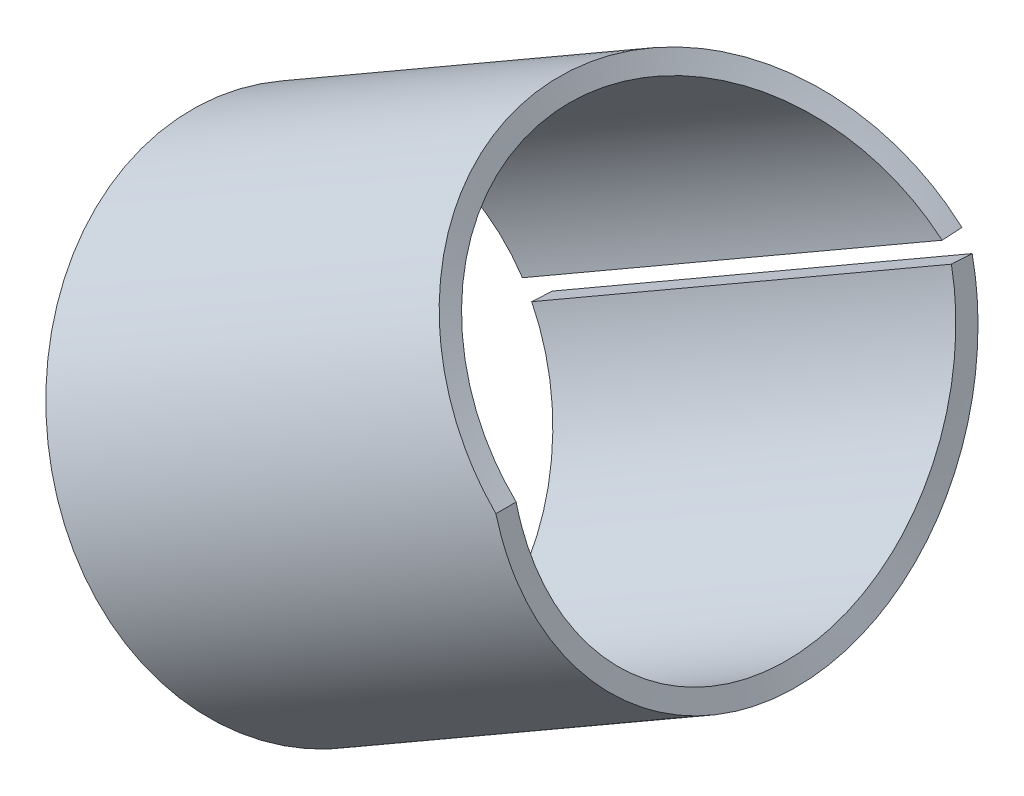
ISO-10303-21;
HEADER;
FILE_DESCRIPTION(('STEP AP214'),'2;1');
FILE_NAME('part.step','',(''),(''),'','','');
FILE_SCHEMA(('AUTOMOTIVE_DESIGN { 1 0 10303 214 1 1 1 1 }'));
ENDSEC;
DATA;
#1=APPLICATION_CONTEXT('core data for automotive mechanical design processes');
#2=APPLICATION_PROTOCOL_DEFINITION('international standard','automotive_design',2000,#1);
#3=PRODUCT_CONTEXT('',#1,'mechanical');
#4=PRODUCT('Part','Part','',(#3));
#5=PRODUCT_RELATED_PRODUCT_CATEGORY('part','',(#4));
#6=PRODUCT_DEFINITION_FORMATION('','',#4);
#7=PRODUCT_DEFINITION_CONTEXT('part definition',#1,'design');
#8=PRODUCT_DEFINITION('design','',#6,#7);
#9=PRODUCT_DEFINITION_SHAPE('','',#8);
#10=(LENGTH_UNIT() NAMED_UNIT(*) SI_UNIT(.MILLI.,.METRE.));
#11=(NAMED_UNIT(*) PLANE_ANGLE_UNIT() SI_UNIT($,.RADIAN.));
#12=(NAMED_UNIT(*) SI_UNIT($,.STERADIAN.) SOLID_ANGLE_UNIT());
#13=UNCERTAINTY_MEASURE_WITH_UNIT(LENGTH_MEASURE(1.E-05),#10,'distance_accuracy_value','');
#14=(GEOMETRIC_REPRESENTATION_CONTEXT(3) GLOBAL_UNCERTAINTY_ASSIGNED_CONTEXT((#13)) GLOBAL_UNIT_ASSIGNED_CONTEXT((#10,
#11,#12)) REPRESENTATION_CONTEXT('',''));
#15=CARTESIAN_POINT('',(0.,0.,0.));
#16=DIRECTION('',(0.,0.,1.));
#17=DIRECTION('',(1.,0.,0.));
#18=AXIS2_PLACEMENT_3D('',#15,#16,#17);
#19=CARTESIAN_POINT('',(-34.6410161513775,-20.0000000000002,0.));
#20=DIRECTION('',(0.866025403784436,0.500000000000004,0.));
#21=DIRECTION('',(-0.500000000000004,0.866025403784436,0.));
#22=AXIS2_PLACEMENT_3D('',#19,#20,#21);
#23=PLANE('',#22);
#24=DIRECTION('',(-0.0214301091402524,0.0371180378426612,-0.999081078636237));
#25=VECTOR('',#24,1.);
#26=CARTESIAN_POINT('',(-34.8695860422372,-19.6041053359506,-10.6560284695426));
#27=LINE('',#26,#25);
#28=CARTESIAN_POINT('',(-34.8695860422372,-19.6041053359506,-10.6560284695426));
#29=VERTEX_POINT('',#28);
#30=CARTESIAN_POINT('',(-34.8910161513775,-19.566987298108,-11.6551095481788));
#31=VERTEX_POINT('',#30);
#32=EDGE_CURVE('E13',#29,#31,#27,.T.);
#33=ORIENTED_EDGE('',*,*,#32,.F.);
#34=CARTESIAN_POINT('',(-34.6410161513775,-20.0000000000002,0.));
#35=DIRECTION('',(-0.866025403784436,-0.500000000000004,0.));
#36=DIRECTION('',(0.500000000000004,-0.866025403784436,0.));
#37=AXIS2_PLACEMENT_3D('',#34,#35,#36);
#38=CIRCLE('',#37,10.6658295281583);
#39=CARTESIAN_POINT('',(-34.4124462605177,-20.3958946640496,-10.6560284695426));
#40=VERTEX_POINT('',#39);
#41=EDGE_CURVE('E85',#40,#29,#38,.T.);
#42=ORIENTED_EDGE('',*,*,#41,.F.);
#43=DIRECTION('',(0.0214301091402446,-0.037118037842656,-0.999081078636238));
#44=VECTOR('',#43,1.);
#45=CARTESIAN_POINT('',(-34.4124462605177,-20.3958946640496,-10.6560284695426));
#46=LINE('',#45,#44);
#47=CARTESIAN_POINT('',(-34.3910161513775,-20.4330127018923,-11.6551095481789));
#48=VERTEX_POINT('',#47);
#49=EDGE_CURVE('E50',#40,#48,#46,.T.);
#50=ORIENTED_EDGE('',*,*,#49,.T.);
#51=CARTESIAN_POINT('',(-34.6410161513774,-20.0000000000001,0.));
#52=DIRECTION('',(-0.866025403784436,-0.500000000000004,0.));
#53=DIRECTION('',(0.500000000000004,-0.866025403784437,0.));
#54=AXIS2_PLACEMENT_3D('',#51,#52,#53);
#55=CIRCLE('',#54,11.6658295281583);
#56=EDGE_CURVE('E87',#48,#31,#55,.T.);
#57=ORIENTED_EDGE('',*,*,#56,.T.);
#58=EDGE_LOOP('',(#33,#42,#50,#57));
#59=FACE_BOUND('',#58,.T.);
#60=ADVANCED_FACE('F38',(#59),#23,.F.);
#61=CARTESIAN_POINT('',(-24.0781541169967,-14.4293883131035,-10.6560284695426));
#62=DIRECTION('',(0.499540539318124,-0.865229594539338,0.0428602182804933));
#63=DIRECTION('',(-0.866025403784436,-0.500000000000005,0.));
#64=AXIS2_PLACEMENT_3D('',#61,#62,#63);
#65=PLANE('',#64);
#66=ORIENTED_EDGE('',*,*,#49,.F.);
#67=DIRECTION('',(-0.866025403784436,-0.500000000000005,0.));
#68=VECTOR('',#67,1.);
#69=CARTESIAN_POINT('',(-13.7438619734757,-8.46288196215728,-10.6560284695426));
#70=LINE('',#69,#68);
#71=CARTESIAN_POINT('',(-13.7438619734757,-8.46288196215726,-10.6560284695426));
#72=VERTEX_POINT('',#71);
#73=EDGE_CURVE('E95',#72,#40,#70,.T.);
#74=ORIENTED_EDGE('',*,*,#73,.F.);
#75=CARTESIAN_POINT('',(-13.7224318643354,-8.49999999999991,-11.6551095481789));
#76=CARTESIAN_POINT('',(-13.7438619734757,-8.46288196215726,-10.6560284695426));
#77=B_SPLINE_CURVE_WITH_KNOTS('',1,(#75,#76),.UNSPECIFIED.,.F.,.F.,(2,2),(0.,1.),.UNSPECIFIED.);
#78=CARTESIAN_POINT('',(-13.7224318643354,-8.49999999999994,-11.6551095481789));
#79=VERTEX_POINT('',#78);
#80=EDGE_CURVE('E225',#72,#79,#77,.F.);
#81=ORIENTED_EDGE('',*,*,#80,.T.);
#82=DIRECTION('',(-0.866025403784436,-0.500000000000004,0.));
#83=VECTOR('',#82,1.);
#84=CARTESIAN_POINT('',(62.1866079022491,35.3261045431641,-11.6551095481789));
#85=LINE('',#84,#83);
#86=EDGE_CURVE('E156',#79,#48,#85,.T.);
#87=ORIENTED_EDGE('',*,*,#86,.T.);
#88=EDGE_LOOP('',(#66,#74,#81,#87));
#89=FACE_BOUND('',#88,.T.);
#90=ADVANCED_FACE('F191',(#89),#65,.F.);
#91=CARTESIAN_POINT('',(-13.856406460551,-8.00000000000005,11.6658295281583));
#92=CARTESIAN_POINT('',(-13.7267507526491,-8.48387195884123,11.6658295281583));
#93=CARTESIAN_POINT('',(-13.612443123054,-8.90970699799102,11.6361509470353));
#94=CARTESIAN_POINT('',(-13.4650106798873,-9.45993435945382,11.575574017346));
#95=CARTESIAN_POINT('',(-13.4198470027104,-9.62861624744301,11.5526270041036));
#96=CARTESIAN_POINT('',(-13.3580081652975,-9.85965912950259,11.5169060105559));
#97=CARTESIAN_POINT('',(-13.3383786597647,-9.93301184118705,11.5047771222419));
#98=CARTESIAN_POINT('',(-13.310394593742,-10.0375744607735,11.4865585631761));
#99=CARTESIAN_POINT('',(-13.301309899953,-10.0715176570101,11.4804811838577));
#100=CARTESIAN_POINT('',(-13.2880457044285,-10.1210696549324,11.471393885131));
#101=CARTESIAN_POINT('',(-13.2836847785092,-10.137359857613,11.4683695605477));
#102=CARTESIAN_POINT('',(-13.277233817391,-10.1614549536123,11.4638445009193));
#103=CARTESIAN_POINT('',(-13.2750985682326,-10.1694299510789,11.4623380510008));
#104=CARTESIAN_POINT('',(-13.2719182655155,-10.1813074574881,11.4600817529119));
#105=CARTESIAN_POINT('',(-13.2708619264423,-10.1852524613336,11.4593302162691));
#106=CARTESIAN_POINT('',(-13.2692830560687,-10.1911487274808,11.4582038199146));
#107=CARTESIAN_POINT('',(-13.26875770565,-10.1931106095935,11.4578285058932));
#108=CARTESIAN_POINT('',(-13.2679710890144,-10.1960481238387,11.4572657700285));
#109=CARTESIAN_POINT('',(-13.2677091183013,-10.1970264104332,11.4570782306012));
#110=CARTESIAN_POINT('',(-13.2671856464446,-10.1989812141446,11.4567032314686));
#111=CARTESIAN_POINT('',(-13.267078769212,-10.1993803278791,11.4566266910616));
#112=CARTESIAN_POINT('',(-13.1601949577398,-10.5985105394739,11.379953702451));
#113=CARTESIAN_POINT('',(-13.0592742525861,-10.9749124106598,11.2862045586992));
#114=CARTESIAN_POINT('',(-12.9166911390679,-11.5069258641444,11.1277651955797));
#115=CARTESIAN_POINT('',(-12.8706222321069,-11.6788451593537,11.0719749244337));
#116=CARTESIAN_POINT('',(-12.80370665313,-11.9285970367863,10.9847776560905));
#117=CARTESIAN_POINT('',(-12.7817657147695,-12.0104938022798,10.955126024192));
#118=CARTESIAN_POINT('',(-12.749397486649,-12.1313137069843,10.9098837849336));
#119=CARTESIAN_POINT('',(-12.7386985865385,-12.1712495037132,10.8946755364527));
#120=CARTESIAN_POINT('',(-12.7227854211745,-12.2306479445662,10.8716858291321));
#121=CARTESIAN_POINT('',(-12.7175035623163,-12.2503632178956,10.8639930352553));
#122=CARTESIAN_POINT('',(-12.7096144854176,-12.2798099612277,10.8524112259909));
#123=CARTESIAN_POINT('',(-12.7069904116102,-12.2896045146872,10.848543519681));
#124=CARTESIAN_POINT('',(-12.7030627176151,-12.3042648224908,10.8427315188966));
#125=CARTESIAN_POINT('',(-12.701754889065,-12.3091463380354,10.8407924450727));
#126=CARTESIAN_POINT('',(-12.6997952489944,-12.316460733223,10.8378812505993));
#127=CARTESIAN_POINT('',(-12.6991423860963,-12.3188975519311,10.836910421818));
#128=CARTESIAN_POINT('',(-12.6978373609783,-12.3237685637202,10.8349679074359));
#129=CARTESIAN_POINT('',(-12.6973310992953,-12.3256581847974,10.834213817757));
#130=CARTESIAN_POINT('',(-12.4923189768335,-13.0908634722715,10.5284589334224));
#131=CARTESIAN_POINT('',(-12.3056976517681,-13.7855407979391,10.1574532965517));
#132=CARTESIAN_POINT('',(-12.0549663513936,-14.7213621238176,9.54207432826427));
#133=CARTESIAN_POINT('',(-11.9761874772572,-15.0157221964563,9.32708785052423));
#134=CARTESIAN_POINT('',(-11.8650370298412,-15.4312026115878,8.99438187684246));
#135=CARTESIAN_POINT('',(-11.8291533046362,-15.5653583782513,8.88177128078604));
#136=CARTESIAN_POINT('',(-11.7770285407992,-15.7601700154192,8.71082316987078));
#137=CARTESIAN_POINT('',(-11.7599369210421,-15.824037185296,8.65350147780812));
#138=CARTESIAN_POINT('',(-11.7347168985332,-15.9182459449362,8.56707418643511));
#139=CARTESIAN_POINT('',(-11.7263797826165,-15.9493835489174,8.53819094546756));
#140=CARTESIAN_POINT('',(-11.7139774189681,-15.9956937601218,8.49476266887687));
#141=CARTESIAN_POINT('',(-11.7098605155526,-16.0110644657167,8.48026933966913));
#142=CARTESIAN_POINT('',(-11.703710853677,-16.0340217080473,8.45850445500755));
#143=CARTESIAN_POINT('',(-11.7016652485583,-16.0416576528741,8.45124534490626));
#144=CARTESIAN_POINT('',(-11.6986032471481,-16.05308689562,8.44035057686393));
#145=CARTESIAN_POINT('',(-11.6975836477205,-16.05689253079,8.43671797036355));
#146=CARTESIAN_POINT('',(-11.6955465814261,-16.0644955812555,8.42945074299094));
#147=CARTESIAN_POINT('',(-11.6947104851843,-16.0676161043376,8.42646487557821));
#148=CARTESIAN_POINT('',(-11.5401978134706,-16.644271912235,7.87378094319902));
#149=CARTESIAN_POINT('',(-11.4050519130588,-17.1475665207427,7.27912895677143));
#150=CARTESIAN_POINT('',(-11.231206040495,-17.7963669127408,6.34537313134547));
#151=CARTESIAN_POINT('',(-11.1780324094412,-17.9950078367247,6.02713699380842));
#152=CARTESIAN_POINT('',(-11.1053332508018,-18.2667056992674,5.54251018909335));
#153=CARTESIAN_POINT('',(-11.0822751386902,-18.3528977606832,5.37975381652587));
#154=CARTESIAN_POINT('',(-11.0494212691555,-18.4756754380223,5.13417922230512));
#155=CARTESIAN_POINT('',(-11.0387587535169,-18.5155164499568,5.05208087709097));
#156=CARTESIAN_POINT('',(-11.0231935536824,-18.5736585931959,4.92861947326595));
#157=CARTESIAN_POINT('',(-11.0180765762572,-18.5927694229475,4.88741334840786));
#158=CARTESIAN_POINT('',(-11.0105076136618,-18.6210319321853,4.82553138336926));
#159=CARTESIAN_POINT('',(-11.0080023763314,-18.63038548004,4.80489193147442));
#160=CARTESIAN_POINT('',(-11.0042710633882,-18.644315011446,4.77391526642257));
#161=CARTESIAN_POINT('',(-11.0030317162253,-18.6489413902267,4.76358679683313));
#162=CARTESIAN_POINT('',(-11.0005618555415,-18.6581605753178,4.74292414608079));
#163=CARTESIAN_POINT('',(-10.9994239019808,-18.6624079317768,4.73337031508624));
#164=CARTESIAN_POINT('',(-10.9137107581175,-18.982304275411,4.01074396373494));
#165=CARTESIAN_POINT('',(-10.8488888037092,-19.2234399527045,3.27288172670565));
#166=CARTESIAN_POINT('',(-10.7821973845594,-19.4723361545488,2.14982395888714));
#167=CARTESIAN_POINT('',(-10.7650315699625,-19.5365446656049,1.77275635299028));
#168=CARTESIAN_POINT('',(-10.7468063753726,-19.6048493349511,1.20591223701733));
#169=CARTESIAN_POINT('',(-10.7419837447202,-19.6229521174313,1.01675632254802));
#170=CARTESIAN_POINT('',(-10.7366062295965,-19.6431466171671,0.733056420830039));
#171=CARTESIAN_POINT('',(-10.7351230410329,-19.648718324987,0.638495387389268));
#172=CARTESIAN_POINT('',(-10.7333586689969,-19.6553423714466,0.496704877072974));
#173=CARTESIAN_POINT('',(-10.7328472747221,-19.6572614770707,0.449449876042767));
#174=CARTESIAN_POINT('',(-10.7319772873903,-19.6605230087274,0.354963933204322));
#175=CARTESIAN_POINT('',(-10.7316235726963,-19.6618472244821,0.308548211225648));
#176=CARTESIAN_POINT('',(-10.7307613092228,-19.6650659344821,0.164456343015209));
#177=CARTESIAN_POINT('',(-10.7305067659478,-19.6660197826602,0.0673725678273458));
#178=CARTESIAN_POINT('',(-10.7306253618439,-19.6655759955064,-0.122023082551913));
#179=CARTESIAN_POINT('',(-10.7309903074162,-19.6641988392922,-0.216795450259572));
#180=CARTESIAN_POINT('',(-10.7330099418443,-19.6565879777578,-0.501251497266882));
#181=CARTESIAN_POINT('',(-10.7355897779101,-19.6468742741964,-0.69107435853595));
#182=CARTESIAN_POINT('',(-10.7470799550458,-19.6037264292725,-1.26041287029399));
#183=CARTESIAN_POINT('',(-10.7597468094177,-19.5562754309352,-1.63980138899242));
#184=CARTESIAN_POINT('',(-10.8129657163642,-19.3575219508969,-2.77183950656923));
#185=CARTESIAN_POINT('',(-10.868836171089,-19.1496456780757,-3.51837815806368));
#186=CARTESIAN_POINT('',(-10.9491963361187,-18.8498490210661,-4.28657063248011));
#187=CARTESIAN_POINT('',(-10.9540000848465,-18.8319246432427,-4.33166641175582));
#188=CARTESIAN_POINT('',(-10.9613201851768,-18.8046050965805,-4.39916639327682));
#189=CARTESIAN_POINT('',(-10.9638008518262,-18.7953459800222,-4.42183061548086));
#190=CARTESIAN_POINT('',(-10.9684406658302,-18.7780256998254,-4.46388066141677));
#191=CARTESIAN_POINT('',(-10.9707783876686,-18.7692979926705,-4.48489481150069));
#192=CARTESIAN_POINT('',(-10.9825563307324,-18.7253211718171,-4.58990887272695));
#193=CARTESIAN_POINT('',(-10.9922645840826,-18.6890571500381,-4.67373876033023));
#194=CARTESIAN_POINT('',(-11.022256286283,-18.5770013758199,-4.92459400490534));
#195=CARTESIAN_POINT('',(-11.0434070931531,-18.4979451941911,-5.09098547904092));
#196=CARTESIAN_POINT('',(-11.1103879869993,-18.2476166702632,-5.58688136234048));
#197=CARTESIAN_POINT('',(-11.1597539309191,-18.0631715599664,-5.913114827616));
#198=CARTESIAN_POINT('',(-11.3222124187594,-17.4567689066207,-6.87249088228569));
#199=CARTESIAN_POINT('',(-11.4498062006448,-16.9815005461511,-7.48638992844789));
#200=CARTESIAN_POINT('',(-11.6003118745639,-16.419835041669,-8.07455932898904));
#201=CARTESIAN_POINT('',(-11.6048903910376,-16.4027474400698,-8.09234000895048));
#202=CARTESIAN_POINT('',(-11.6140827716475,-16.3684375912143,-8.12781497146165));
#203=CARTESIAN_POINT('',(-11.6189716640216,-16.3501888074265,-8.14655179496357));
#204=CARTESIAN_POINT('',(-11.6309153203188,-16.3056019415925,-8.19208531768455));
#205=CARTESIAN_POINT('',(-11.6389457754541,-16.2756158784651,-8.22237527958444));
#206=CARTESIAN_POINT('',(-11.6632432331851,-16.1848696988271,-8.313033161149));
#207=CARTESIAN_POINT('',(-11.6797163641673,-16.1233215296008,-8.37318914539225));
#208=CARTESIAN_POINT('',(-11.7299752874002,-15.9354988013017,-8.55268804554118));
#209=CARTESIAN_POINT('',(-11.7646012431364,-15.8060449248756,-8.67106298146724));
#210=CARTESIAN_POINT('',(-11.8719378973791,-15.4047960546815,-9.02130569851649));
#211=CARTESIAN_POINT('',(-11.9481193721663,-15.1200930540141,-9.24830729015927));
#212=CARTESIAN_POINT('',(-12.1909310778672,-14.2136866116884,-9.90116035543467));
#213=CARTESIAN_POINT('',(-12.3720818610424,-13.5392470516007,-10.299044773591));
#214=CARTESIAN_POINT('',(-12.5740475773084,-12.7857636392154,-10.6389907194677));
#215=CARTESIAN_POINT('',(-12.5771589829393,-12.7741552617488,-10.6442051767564));
#216=CARTESIAN_POINT('',(-12.5833902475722,-12.7509059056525,-10.6546029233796));
#217=CARTESIAN_POINT('',(-12.586739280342,-12.7384097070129,-10.6601639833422));
#218=CARTESIAN_POINT('',(-12.5944845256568,-12.7095091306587,-10.6729792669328));
#219=CARTESIAN_POINT('',(-12.5996702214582,-12.6901583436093,-10.6814973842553));
#220=CARTESIAN_POINT('',(-12.6152941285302,-12.6318543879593,-10.7069721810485));
#221=CARTESIAN_POINT('',(-12.6257991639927,-12.5926496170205,-10.7238493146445));
#222=CARTESIAN_POINT('',(-12.6575831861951,-12.4740260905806,-10.7741354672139));
#223=CARTESIAN_POINT('',(-12.6791311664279,-12.3935979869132,-10.807199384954));
#224=CARTESIAN_POINT('',(-12.7448613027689,-12.1482585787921,-10.9047888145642));
#225=CARTESIAN_POINT('',(-12.7901310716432,-11.97928972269,-10.9677142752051));
#226=CARTESIAN_POINT('',(-12.9303243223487,-11.4560949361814,-11.1482305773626));
#227=CARTESIAN_POINT('',(-13.0296602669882,-11.0855313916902,-11.2575936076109));
#228=CARTESIAN_POINT('',(-13.1363009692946,-10.6874394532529,-11.3520599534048));
#229=CARTESIAN_POINT('',(-13.1379429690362,-10.6813097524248,-11.3535092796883));
#230=CARTESIAN_POINT('',(-13.1412297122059,-10.6690399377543,-11.3563998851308));
#231=CARTESIAN_POINT('',(-13.1430781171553,-10.6621395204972,-11.3580185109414));
#232=CARTESIAN_POINT('',(-13.1465703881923,-10.6491020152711,-11.3610689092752));
#233=CARTESIAN_POINT('',(-13.1489099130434,-10.6403675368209,-11.3631019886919));
#234=CARTESIAN_POINT('',(-13.155962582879,-10.6140355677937,-11.3691988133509));
#235=CARTESIAN_POINT('',(-13.1607098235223,-10.5963095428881,-11.3732601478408));
#236=CARTESIAN_POINT('',(-13.1750884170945,-10.5426164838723,-11.3854275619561));
#237=CARTESIAN_POINT('',(-13.1848566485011,-10.5061344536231,-11.3935170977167));
#238=CARTESIAN_POINT('',(-13.2147125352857,-10.3946220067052,-11.417662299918));
#239=CARTESIAN_POINT('',(-13.2353515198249,-10.3175249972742,-11.4335952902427));
#240=CARTESIAN_POINT('',(-13.2994987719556,-10.0779243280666,-11.4804191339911));
#241=CARTESIAN_POINT('',(-13.345240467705,-9.90710560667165,-11.5103464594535));
#242=CARTESIAN_POINT('',(-13.4915035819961,-9.36120851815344,-11.5919742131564));
#243=CARTESIAN_POINT('',(-13.6011265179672,-8.9526217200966,-11.6356916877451));
#244=CARTESIAN_POINT('',(-13.7224318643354,-8.49999999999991,-11.6551095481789));
#245=CARTESIAN_POINT('',(-13.856406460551,-8.00000000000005,10.6658295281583));
#246=CARTESIAN_POINT('',(-13.7474899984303,-8.44794974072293,10.6658295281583));
#247=CARTESIAN_POINT('',(-13.65143782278,-8.84216619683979,10.6386950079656));
#248=CARTESIAN_POINT('',(-13.527588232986,-9.3515468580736,10.5833107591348));
#249=CARTESIAN_POINT('',(-13.4896535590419,-9.50770774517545,10.5623307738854));
#250=CARTESIAN_POINT('',(-13.4377157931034,-9.72160146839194,10.5296717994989));
#251=CARTESIAN_POINT('',(-13.4212296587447,-9.78950970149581,10.5185826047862));
#252=CARTESIAN_POINT('',(-13.3977264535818,-9.88631124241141,10.501925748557));
#253=CARTESIAN_POINT('',(-13.3900963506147,-9.91773501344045,10.496369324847));
#254=CARTESIAN_POINT('',(-13.3789556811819,-9.96360895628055,10.4880609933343));
#255=CARTESIAN_POINT('',(-13.3752928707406,-9.97868998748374,10.4852959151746));
#256=CARTESIAN_POINT('',(-13.3698745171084,-10.0009965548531,10.481158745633));
#257=CARTESIAN_POINT('',(-13.3680810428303,-10.0083795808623,10.4797814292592));
#258=CARTESIAN_POINT('',(-13.3654097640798,-10.019375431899,10.4777185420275));
#259=CARTESIAN_POINT('',(-13.3645224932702,-10.0230276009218,10.4770314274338));
#260=CARTESIAN_POINT('',(-13.3631963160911,-10.0284861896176,10.4760015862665));
#261=CARTESIAN_POINT('',(-13.3627550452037,-10.0303024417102,10.4756584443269));
#262=CARTESIAN_POINT('',(-13.3620943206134,-10.0330219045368,10.4751439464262));
#263=CARTESIAN_POINT('',(-13.3618742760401,-10.0339275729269,10.4749724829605));
#264=CARTESIAN_POINT('',(-13.3614345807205,-10.0357372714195,10.4746296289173));
#265=CARTESIAN_POINT('',(-13.3613448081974,-10.0361067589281,10.4745596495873));
#266=CARTESIAN_POINT('',(-13.2715664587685,-10.405609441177,10.4044591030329));
#267=CARTESIAN_POINT('',(-13.1867797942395,-10.7540663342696,10.3187461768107));
#268=CARTESIAN_POINT('',(-13.0669995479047,-11.2465840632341,10.1738883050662));
#269=CARTESIAN_POINT('',(-13.0282992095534,-11.4057406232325,10.1228804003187));
#270=CARTESIAN_POINT('',(-12.972087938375,-11.6369520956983,10.0431577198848));
#271=CARTESIAN_POINT('',(-12.9536570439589,-11.7127692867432,10.0160478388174));
#272=CARTESIAN_POINT('',(-12.9264670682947,-11.824620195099,9.97468378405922));
#273=CARTESIAN_POINT('',(-12.9174797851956,-11.8615913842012,9.96077919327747));
#274=CARTESIAN_POINT('',(-12.9041123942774,-11.9165804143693,9.93976017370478));
#275=CARTESIAN_POINT('',(-12.8996755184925,-11.9348321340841,9.93272680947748));
#276=CARTESIAN_POINT('',(-12.8930485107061,-11.9620929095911,9.92213779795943));
#277=CARTESIAN_POINT('',(-12.8908442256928,-11.9711603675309,9.91860163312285));
#278=CARTESIAN_POINT('',(-12.8875448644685,-11.9847323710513,9.91328783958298));
#279=CARTESIAN_POINT('',(-12.8864462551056,-11.9892515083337,9.91151498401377));
#280=CARTESIAN_POINT('',(-12.884800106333,-11.9960229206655,9.90885333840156));
#281=CARTESIAN_POINT('',(-12.8842516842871,-11.9982788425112,9.90796572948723));
#282=CARTESIAN_POINT('',(-12.8831554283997,-12.0027882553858,9.90618972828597));
#283=CARTESIAN_POINT('',(-12.8827301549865,-12.0045376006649,9.90550027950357));
#284=CARTESIAN_POINT('',(-12.710514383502,-12.7129379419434,9.62595483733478));
#285=CARTESIAN_POINT('',(-12.5536774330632,-13.3560272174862,9.28675196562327));
#286=CARTESIAN_POINT('',(-12.3430551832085,-14.2223776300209,8.72412355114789));
#287=CARTESIAN_POINT('',(-12.2768906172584,-14.4948890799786,8.52756580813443));
#288=CARTESIAN_POINT('',(-12.1835439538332,-14.8795324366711,8.22337953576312));
#289=CARTESIAN_POINT('',(-12.1534088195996,-15.0037313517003,8.12042196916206));
#290=CARTESIAN_POINT('',(-12.1096321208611,-15.1840837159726,7.96412760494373));
#291=CARTESIAN_POINT('',(-12.0952774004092,-15.2432104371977,7.9117195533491));
#292=CARTESIAN_POINT('',(-12.0740946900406,-15.3304263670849,7.83270084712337));
#293=CARTESIAN_POINT('',(-12.0670920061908,-15.3592526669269,7.80629349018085));
#294=CARTESIAN_POINT('',(-12.056674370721,-15.4021252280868,7.76658790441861));
#295=CARTESIAN_POINT('',(-12.053216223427,-15.4163549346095,7.75333694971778));
#296=CARTESIAN_POINT('',(-12.0480504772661,-15.4376079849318,7.73343776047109));
#297=CARTESIAN_POINT('',(-12.0463321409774,-15.4446770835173,7.72680090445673));
#298=CARTESIAN_POINT('',(-12.0437599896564,-15.4552578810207,7.71684004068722));
#299=CARTESIAN_POINT('',(-12.0429034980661,-15.4587810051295,7.71351882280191));
#300=CARTESIAN_POINT('',(-12.0411922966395,-15.4658196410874,7.70687454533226));
#301=CARTESIAN_POINT('',(-12.0404899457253,-15.4687085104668,7.70414462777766));
#302=CARTESIAN_POINT('',(-11.9106928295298,-16.0025557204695,7.19883700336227));
#303=CARTESIAN_POINT('',(-11.7971244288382,-16.4684770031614,6.65515884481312));
#304=CARTESIAN_POINT('',(-11.6510862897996,-17.0691129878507,5.80144497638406));
#305=CARTESIAN_POINT('',(-11.6064253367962,-17.2530095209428,5.51048817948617));
#306=CARTESIAN_POINT('',(-11.5453690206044,-17.5045413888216,5.06740379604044));
#307=CARTESIAN_POINT('',(-11.5260043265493,-17.58433626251,4.91859897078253));
#308=CARTESIAN_POINT('',(-11.4984117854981,-17.6980010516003,4.69407513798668));
#309=CARTESIAN_POINT('',(-11.489456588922,-17.7348849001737,4.61901429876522));
#310=CARTESIAN_POINT('',(-11.4763830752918,-17.7887113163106,4.50613606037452));
#311=CARTESIAN_POINT('',(-11.4720851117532,-17.8064035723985,4.46846214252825));
#312=CARTESIAN_POINT('',(-11.4657274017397,-17.8325681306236,4.41188472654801));
#313=CARTESIAN_POINT('',(-11.463623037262,-17.8412273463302,4.39301449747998));
#314=CARTESIAN_POINT('',(-11.4604887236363,-17.8541228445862,4.36469316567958));
#315=CARTESIAN_POINT('',(-11.459447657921,-17.8584057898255,4.35525005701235));
#316=CARTESIAN_POINT('',(-11.4573729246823,-17.8669405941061,4.336358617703));
#317=CARTESIAN_POINT('',(-11.4564170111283,-17.8708726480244,4.32762374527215));
#318=CARTESIAN_POINT('',(-11.3844146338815,-18.1670212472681,3.66694124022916));
#319=CARTESIAN_POINT('',(-11.3299323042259,-18.3902481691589,2.99232887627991));
#320=CARTESIAN_POINT('',(-11.2739086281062,-18.620667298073,1.96554011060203));
#321=CARTESIAN_POINT('',(-11.2594939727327,-18.6801106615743,1.62079490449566));
#322=CARTESIAN_POINT('',(-11.2441946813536,-18.7433475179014,1.10254091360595));
#323=CARTESIAN_POINT('',(-11.2401473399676,-18.7601074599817,0.929599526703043));
#324=CARTESIAN_POINT('',(-11.2356346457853,-18.7788040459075,0.670218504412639));
#325=CARTESIAN_POINT('',(-11.2343900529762,-18.7839624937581,0.583763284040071));
#326=CARTESIAN_POINT('',(-11.2329093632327,-18.790095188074,0.454127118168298));
#327=CARTESIAN_POINT('',(-11.2324801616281,-18.7918719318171,0.41092283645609));
#328=CARTESIAN_POINT('',(-11.2317498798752,-18.794891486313,0.324536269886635));
#329=CARTESIAN_POINT('',(-11.2314528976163,-18.7961174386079,0.282099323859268));
#330=CARTESIAN_POINT('',(-11.2307285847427,-18.7990972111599,0.150359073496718));
#331=CARTESIAN_POINT('',(-11.2305149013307,-18.7999802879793,0.0615973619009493));
#332=CARTESIAN_POINT('',(-11.2306144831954,-18.799569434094,-0.111563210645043));
#333=CARTESIAN_POINT('',(-11.2309204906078,-18.7982943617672,-0.198211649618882));
#334=CARTESIAN_POINT('',(-11.2326143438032,-18.79124776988,-0.458284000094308));
#335=CARTESIAN_POINT('',(-11.2347783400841,-18.7822543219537,-0.631835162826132));
#336=CARTESIAN_POINT('',(-11.244420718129,-18.7423069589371,-1.15236972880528));
#337=CARTESIAN_POINT('',(-11.2550548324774,-18.6983767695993,-1.49923689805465));
#338=CARTESIAN_POINT('',(-11.2997559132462,-18.5143765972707,-2.53423621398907));
#339=CARTESIAN_POINT('',(-11.3467130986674,-18.3219385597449,-3.21678124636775));
#340=CARTESIAN_POINT('',(-11.41422327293,-18.0443987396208,-3.91912392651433));
#341=CARTESIAN_POINT('',(-11.418258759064,-18.0278050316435,-3.96035407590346));
#342=CARTESIAN_POINT('',(-11.4244079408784,-18.0025135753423,-4.02206792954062));
#343=CARTESIAN_POINT('',(-11.4264917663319,-17.9939418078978,-4.04278936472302));
#344=CARTESIAN_POINT('',(-11.4303892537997,-17.9779072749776,-4.0812348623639));
#345=CARTESIAN_POINT('',(-11.4323529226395,-17.9698274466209,-4.10044767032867));
#346=CARTESIAN_POINT('',(-11.4422461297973,-17.9291150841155,-4.19645988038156));
#347=CARTESIAN_POINT('',(-11.450400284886,-17.8955428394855,-4.27310383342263));
#348=CARTESIAN_POINT('',(-11.475589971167,-17.7918044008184,-4.50245565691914));
#349=CARTESIAN_POINT('',(-11.493353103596,-17.718615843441,-4.6545839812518));
#350=CARTESIAN_POINT('',(-11.5496068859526,-17.4868672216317,-5.1079714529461));
#351=CARTESIAN_POINT('',(-11.5910686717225,-17.3161125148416,-5.4062400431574));
#352=CARTESIAN_POINT('',(-11.7275371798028,-16.7547258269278,-6.28337796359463));
#353=CARTESIAN_POINT('',(-11.8347555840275,-16.31474865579,-6.84465331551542));
#354=CARTESIAN_POINT('',(-11.961187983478,-15.794779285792,-7.38240457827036));
#355=CARTESIAN_POINT('',(-11.9650341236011,-15.7789601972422,-7.39866109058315));
#356=CARTESIAN_POINT('',(-11.9727559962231,-15.7471973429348,-7.43109512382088));
#357=CARTESIAN_POINT('',(-11.9768627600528,-15.7303032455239,-7.44822581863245));
#358=CARTESIAN_POINT('',(-11.9868954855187,-15.6890262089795,-7.48985618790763));
#359=CARTESIAN_POINT('',(-11.9936408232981,-15.6612660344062,-7.51754968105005));
#360=CARTESIAN_POINT('',(-12.0140492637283,-15.5772558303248,-7.60043632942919));
#361=CARTESIAN_POINT('',(-12.0278848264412,-15.5202760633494,-7.65543571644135));
#362=CARTESIAN_POINT('',(-12.0700950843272,-15.3463940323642,-7.81954789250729));
#363=CARTESIAN_POINT('',(-12.0991739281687,-15.2265480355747,-7.92777567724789));
#364=CARTESIAN_POINT('',(-12.1893167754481,-14.8550797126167,-8.24799543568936));
#365=CARTESIAN_POINT('',(-12.2532980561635,-14.591508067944,-8.45553835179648));
#366=CARTESIAN_POINT('',(-12.4572622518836,-13.7523874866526,-9.05242856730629));
#367=CARTESIAN_POINT('',(-12.6094970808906,-13.1280318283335,-9.41620615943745));
#368=CARTESIAN_POINT('',(-12.7791668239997,-12.4304866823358,-9.7270117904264));
#369=CARTESIAN_POINT('',(-12.7817806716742,-12.4197401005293,-9.73177926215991));
#370=CARTESIAN_POINT('',(-12.7870154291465,-12.3982167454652,-9.74128570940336));
#371=CARTESIAN_POINT('',(-12.7898288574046,-12.3866482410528,-9.74637007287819));
#372=CARTESIAN_POINT('',(-12.7963353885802,-12.3598931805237,-9.75808682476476));
#373=CARTESIAN_POINT('',(-12.8006916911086,-12.3419789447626,-9.7658747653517));
#374=CARTESIAN_POINT('',(-12.8138166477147,-12.2880032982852,-9.78916585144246));
#375=CARTESIAN_POINT('',(-12.8226413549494,-12.2517089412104,-9.80459626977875));
#376=CARTESIAN_POINT('',(-12.8493411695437,-12.141891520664,-9.85057187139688));
#377=CARTESIAN_POINT('',(-12.8674420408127,-12.0674339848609,-9.88080153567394));
#378=CARTESIAN_POINT('',(-12.9226570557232,-11.8403073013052,-9.97002555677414));
#379=CARTESIAN_POINT('',(-12.9606848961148,-11.6838818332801,-10.0275570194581));
#380=CARTESIAN_POINT('',(-13.0784538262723,-11.1995271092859,-10.1925993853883));
#381=CARTESIAN_POINT('',(-13.161906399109,-10.8564743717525,-10.2925877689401));
#382=CARTESIAN_POINT('',(-13.2514853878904,-10.4879341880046,-10.3789564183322));
#383=CARTESIAN_POINT('',(-13.252864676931,-10.4822595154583,-10.380281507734));
#384=CARTESIAN_POINT('',(-13.2556255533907,-10.4709005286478,-10.382924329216));
#385=CARTESIAN_POINT('',(-13.2571782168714,-10.4645123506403,-10.3844042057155));
#386=CARTESIAN_POINT('',(-13.2601117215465,-10.4524426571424,-10.3871931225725));
#387=CARTESIAN_POINT('',(-13.2620769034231,-10.4443565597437,-10.389051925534));
#388=CARTESIAN_POINT('',(-13.2680010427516,-10.4199792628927,-10.3946261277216));
#389=CARTESIAN_POINT('',(-13.2719885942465,-10.40356905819,-10.398339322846));
#390=CARTESIAN_POINT('',(-13.2840660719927,-10.3538616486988,-10.4094637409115));
#391=CARTESIAN_POINT('',(-13.2922708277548,-10.3200876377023,-10.4168598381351));
#392=CARTESIAN_POINT('',(-13.3173477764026,-10.2168525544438,-10.4389353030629));
#393=CARTESIAN_POINT('',(-13.3346827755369,-10.1454782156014,-10.4535025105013));
#394=CARTESIAN_POINT('',(-13.3885618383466,-9.92366257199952,-10.496312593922));
#395=CARTESIAN_POINT('',(-13.4269828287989,-9.76552368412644,-10.5236745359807));
#396=CARTESIAN_POINT('',(-13.5498488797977,-9.26015149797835,-10.5983051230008));
#397=CARTESIAN_POINT('',(-13.6419568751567,-8.88190091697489,-10.6382751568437));
#398=CARTESIAN_POINT('',(-13.7438619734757,-8.46288196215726,-10.6560284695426));
#399=B_SPLINE_SURFACE_WITH_KNOTS('',1,3,((#91,#92,#93,#94,#95,#96,#97,#98,#99,#100,#101,#102,
#103,#104,#105,#106,#107,#108,#109,#110,#111,#112,#113,#114,#115,#116,#117,#118,#119,#120,#121,
#122,#123,#124,#125,#126,#127,#128,#129,#130,#131,#132,#133,#134,#135,#136,#137,#138,#139,#140,
#141,#142,#143,#144,#145,#146,#147,#148,#149,#150,#151,#152,#153,#154,#155,#156,#157,#158,#159,
#160,#161,#162,#163,#164,#165,#166,#167,#168,#169,#170,#171,#172,#173,#174,#175,#176,#177,#178,
#179,#180,#181,#182,#183,#184,#185,#186,#187,#188,#189,#190,#191,#192,#193,#194,#195,#196,#197,
#198,#199,#200,#201,#202,#203,#204,#205,#206,#207,#208,#209,#210,#211,#212,#213,#214,#215,#216,
#217,#218,#219,#220,#221,#222,#223,#224,#225,#226,#227,#228,#229,#230,#231,#232,#233,#234,#235,
#236,#237,#238,#239,#240,#241,#242,#243,#244),(#245,#246,#247,#248,#249,#250,#251,#252,#253,
#254,#255,#256,#257,#258,#259,#260,#261,#262,#263,#264,#265,#266,#267,#268,#269,#270,#271,#272,
#273,#274,#275,#276,#277,#278,#279,#280,#281,#282,#283,#284,#285,#286,#287,#288,#289,#290,#291,
#292,#293,#294,#295,#296,#297,#298,#299,#300,#301,#302,#303,#304,#305,#306,#307,#308,#309,#310,
#311,#312,#313,#314,#315,#316,#317,#318,#319,#320,#321,#322,#323,#324,#325,#326,#327,#328,#329,
#330,#331,#332,#333,#334,#335,#336,#337,#338,#339,#340,#341,#342,#343,#344,#345,#346,#347,#348,
#349,#350,#351,#352,#353,#354,#355,#356,#357,#358,#359,#360,#361,#362,#363,#364,#365,#366,#367,
#368,#369,#370,#371,#372,#373,#374,#375,#376,#377,#378,#379,#380,#381,#382,#383,#384,#385,#386,
#387,#388,#389,#390,#391,#392,#393,#394,#395,#396,#397,#398)),.UNSPECIFIED.,.F.,.F.,.F.,(2,2),
(4,2,2,2,2,2,2,2,2,2,2,2,2,2,2,2,2,2,2,2,2,2,2,2,2,2,2,2,2,2,2,2,2,2,2,2,2,2,2,2,2,2,2,2,2,2,2,
2,2,2,2,2,2,2,2,2,2,2,2,2,2,2,2,2,2,2,2,2,2,2,2,2,2,2,2,2,4),(0.,1.),(0.,0.03125,0.046875,
0.0546875,0.05859375,0.060546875,0.0615234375,0.06201171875,0.062255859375,0.0623779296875,
0.0625,0.09375,0.109375,0.1171875,0.12109375,0.123046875,0.1240234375,0.12451171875,
0.124755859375,0.125,0.1875,0.21875,0.234375,0.2421875,0.24609375,0.248046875,0.2490234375,
0.24951171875,0.25,0.3125,0.34375,0.359375,0.3671875,0.37109375,0.373046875,0.3740234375,0.375,
0.4375,0.46875,0.484375,0.4921875,0.49609375,0.5,0.5078125,0.515625,0.53125,0.5625,0.625,
0.62890625,0.630859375,0.6328125,0.640625,0.65625,0.6875,0.75,0.751953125,0.75390625,0.7578125,
0.765625,0.78125,0.8125,0.875,0.8759765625,0.876953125,0.87890625,0.8828125,0.890625,0.90625,
0.9375,0.93798828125,0.9384765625,0.939453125,0.94140625,0.9453125,0.953125,0.96875,1.),.UNSPECIFIED.);
#400=CARTESIAN_POINT('',(-13.7438619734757,-8.46288196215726,-10.6560284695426));
#401=CARTESIAN_POINT('',(-13.6419568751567,-8.88190091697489,-10.6382751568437));
#402=CARTESIAN_POINT('',(-13.5498488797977,-9.26015149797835,-10.5983051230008));
#403=CARTESIAN_POINT('',(-13.4269828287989,-9.76552368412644,-10.5236745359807));
#404=CARTESIAN_POINT('',(-13.3885618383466,-9.92366257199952,-10.496312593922));
#405=CARTESIAN_POINT('',(-13.3346827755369,-10.1454782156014,-10.4535025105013));
#406=CARTESIAN_POINT('',(-13.3173477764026,-10.2168525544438,-10.4389353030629));
#407=CARTESIAN_POINT('',(-13.2922708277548,-10.3200876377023,-10.4168598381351));
#408=CARTESIAN_POINT('',(-13.2840660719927,-10.3538616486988,-10.4094637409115));
#409=CARTESIAN_POINT('',(-13.2719885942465,-10.40356905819,-10.398339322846));
#410=CARTESIAN_POINT('',(-13.2680010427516,-10.4199792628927,-10.3946261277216));
#411=CARTESIAN_POINT('',(-13.2620769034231,-10.4443565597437,-10.389051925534));
#412=CARTESIAN_POINT('',(-13.2601117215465,-10.4524426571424,-10.3871931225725));
#413=CARTESIAN_POINT('',(-13.2571782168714,-10.4645123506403,-10.3844042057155));
#414=CARTESIAN_POINT('',(-13.2556255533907,-10.4709005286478,-10.382924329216));
#415=CARTESIAN_POINT('',(-13.252864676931,-10.4822595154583,-10.380281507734));
#416=CARTESIAN_POINT('',(-13.2514853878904,-10.4879341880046,-10.3789564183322));
#417=CARTESIAN_POINT('',(-13.161906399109,-10.8564743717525,-10.2925877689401));
#418=CARTESIAN_POINT('',(-13.0784538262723,-11.1995271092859,-10.1925993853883));
#419=CARTESIAN_POINT('',(-12.9606848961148,-11.6838818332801,-10.0275570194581));
#420=CARTESIAN_POINT('',(-12.9226570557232,-11.8403073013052,-9.97002555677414));
#421=CARTESIAN_POINT('',(-12.8674420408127,-12.0674339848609,-9.88080153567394));
#422=CARTESIAN_POINT('',(-12.8493411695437,-12.141891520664,-9.85057187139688));
#423=CARTESIAN_POINT('',(-12.8226413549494,-12.2517089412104,-9.80459626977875));
#424=CARTESIAN_POINT('',(-12.8138166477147,-12.2880032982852,-9.78916585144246));
#425=CARTESIAN_POINT('',(-12.8006916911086,-12.3419789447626,-9.7658747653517));
#426=CARTESIAN_POINT('',(-12.7963353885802,-12.3598931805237,-9.75808682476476));
#427=CARTESIAN_POINT('',(-12.7898288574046,-12.3866482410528,-9.74637007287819));
#428=CARTESIAN_POINT('',(-12.7870154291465,-12.3982167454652,-9.74128570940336));
#429=CARTESIAN_POINT('',(-12.7817806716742,-12.4197401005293,-9.73177926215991));
#430=CARTESIAN_POINT('',(-12.7791668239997,-12.4304866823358,-9.7270117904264));
#431=CARTESIAN_POINT('',(-12.6094970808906,-13.1280318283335,-9.41620615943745));
#432=CARTESIAN_POINT('',(-12.4572622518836,-13.7523874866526,-9.05242856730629));
#433=CARTESIAN_POINT('',(-12.2532980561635,-14.591508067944,-8.45553835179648));
#434=CARTESIAN_POINT('',(-12.1893167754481,-14.8550797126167,-8.24799543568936));
#435=CARTESIAN_POINT('',(-12.0991739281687,-15.2265480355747,-7.92777567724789));
#436=CARTESIAN_POINT('',(-12.0700950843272,-15.3463940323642,-7.81954789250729));
#437=CARTESIAN_POINT('',(-12.0278848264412,-15.5202760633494,-7.65543571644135));
#438=CARTESIAN_POINT('',(-12.0140492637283,-15.5772558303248,-7.60043632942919));
#439=CARTESIAN_POINT('',(-11.9936408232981,-15.6612660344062,-7.51754968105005));
#440=CARTESIAN_POINT('',(-11.9868954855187,-15.6890262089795,-7.48985618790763));
#441=CARTESIAN_POINT('',(-11.9768627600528,-15.7303032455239,-7.44822581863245));
#442=CARTESIAN_POINT('',(-11.9727559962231,-15.7471973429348,-7.43109512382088));
#443=CARTESIAN_POINT('',(-11.9650341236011,-15.7789601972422,-7.39866109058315));
#444=CARTESIAN_POINT('',(-11.961187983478,-15.794779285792,-7.38240457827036));
#445=CARTESIAN_POINT('',(-11.8347555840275,-16.31474865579,-6.84465331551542));
#446=CARTESIAN_POINT('',(-11.7275371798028,-16.7547258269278,-6.28337796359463));
#447=CARTESIAN_POINT('',(-11.5910686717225,-17.3161125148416,-5.4062400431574));
#448=CARTESIAN_POINT('',(-11.5496068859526,-17.4868672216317,-5.1079714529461));
#449=CARTESIAN_POINT('',(-11.493353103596,-17.718615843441,-4.6545839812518));
#450=CARTESIAN_POINT('',(-11.475589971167,-17.7918044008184,-4.50245565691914));
#451=CARTESIAN_POINT('',(-11.450400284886,-17.8955428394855,-4.27310383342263));
#452=CARTESIAN_POINT('',(-11.4422461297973,-17.9291150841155,-4.19645988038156));
#453=CARTESIAN_POINT('',(-11.4323529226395,-17.9698274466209,-4.10044767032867));
#454=CARTESIAN_POINT('',(-11.4303892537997,-17.9779072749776,-4.0812348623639));
#455=CARTESIAN_POINT('',(-11.4264917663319,-17.9939418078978,-4.04278936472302));
#456=CARTESIAN_POINT('',(-11.4244079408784,-18.0025135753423,-4.02206792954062));
#457=CARTESIAN_POINT('',(-11.418258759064,-18.0278050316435,-3.96035407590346));
#458=CARTESIAN_POINT('',(-11.41422327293,-18.0443987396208,-3.91912392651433));
#459=CARTESIAN_POINT('',(-11.3467130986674,-18.3219385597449,-3.21678124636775));
#460=CARTESIAN_POINT('',(-11.2997559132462,-18.5143765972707,-2.53423621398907));
#461=CARTESIAN_POINT('',(-11.2550548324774,-18.6983767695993,-1.49923689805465));
#462=CARTESIAN_POINT('',(-11.244420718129,-18.7423069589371,-1.15236972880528));
#463=CARTESIAN_POINT('',(-11.2347783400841,-18.7822543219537,-0.631835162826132));
#464=CARTESIAN_POINT('',(-11.2326143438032,-18.79124776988,-0.458284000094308));
#465=CARTESIAN_POINT('',(-11.2309204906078,-18.7982943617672,-0.198211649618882));
#466=CARTESIAN_POINT('',(-11.2306144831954,-18.799569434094,-0.111563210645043));
#467=CARTESIAN_POINT('',(-11.2305149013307,-18.7999802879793,0.0615973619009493));
#468=CARTESIAN_POINT('',(-11.2307285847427,-18.7990972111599,0.150359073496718));
#469=CARTESIAN_POINT('',(-11.2314528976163,-18.7961174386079,0.282099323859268));
#470=CARTESIAN_POINT('',(-11.2317498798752,-18.794891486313,0.324536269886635));
#471=CARTESIAN_POINT('',(-11.2324801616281,-18.7918719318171,0.41092283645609));
#472=CARTESIAN_POINT('',(-11.2329093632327,-18.790095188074,0.454127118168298));
#473=CARTESIAN_POINT('',(-11.2343900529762,-18.7839624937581,0.583763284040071));
#474=CARTESIAN_POINT('',(-11.2356346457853,-18.7788040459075,0.670218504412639));
#475=CARTESIAN_POINT('',(-11.2401473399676,-18.7601074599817,0.929599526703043));
#476=CARTESIAN_POINT('',(-11.2441946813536,-18.7433475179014,1.10254091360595));
#477=CARTESIAN_POINT('',(-11.2594939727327,-18.6801106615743,1.62079490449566));
#478=CARTESIAN_POINT('',(-11.2739086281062,-18.620667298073,1.96554011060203));
#479=CARTESIAN_POINT('',(-11.3299323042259,-18.3902481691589,2.99232887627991));
#480=CARTESIAN_POINT('',(-11.3844146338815,-18.1670212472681,3.66694124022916));
#481=CARTESIAN_POINT('',(-11.4564170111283,-17.8708726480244,4.32762374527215));
#482=CARTESIAN_POINT('',(-11.4573729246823,-17.8669405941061,4.336358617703));
#483=CARTESIAN_POINT('',(-11.459447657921,-17.8584057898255,4.35525005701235));
#484=CARTESIAN_POINT('',(-11.4604887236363,-17.8541228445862,4.36469316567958));
#485=CARTESIAN_POINT('',(-11.463623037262,-17.8412273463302,4.39301449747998));
#486=CARTESIAN_POINT('',(-11.4657274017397,-17.8325681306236,4.41188472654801));
#487=CARTESIAN_POINT('',(-11.4720851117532,-17.8064035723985,4.46846214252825));
#488=CARTESIAN_POINT('',(-11.4763830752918,-17.7887113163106,4.50613606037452));
#489=CARTESIAN_POINT('',(-11.489456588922,-17.7348849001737,4.61901429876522));
#490=CARTESIAN_POINT('',(-11.4984117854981,-17.6980010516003,4.69407513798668));
#491=CARTESIAN_POINT('',(-11.5260043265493,-17.58433626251,4.91859897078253));
#492=CARTESIAN_POINT('',(-11.5453690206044,-17.5045413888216,5.06740379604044));
#493=CARTESIAN_POINT('',(-11.6064253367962,-17.2530095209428,5.51048817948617));
#494=CARTESIAN_POINT('',(-11.6510862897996,-17.0691129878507,5.80144497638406));
#495=CARTESIAN_POINT('',(-11.7971244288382,-16.4684770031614,6.65515884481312));
#496=CARTESIAN_POINT('',(-11.9106928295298,-16.0025557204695,7.19883700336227));
#497=CARTESIAN_POINT('',(-12.0404899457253,-15.4687085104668,7.70414462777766));
#498=CARTESIAN_POINT('',(-12.0411922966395,-15.4658196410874,7.70687454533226));
#499=CARTESIAN_POINT('',(-12.0429034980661,-15.4587810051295,7.71351882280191));
#500=CARTESIAN_POINT('',(-12.0437599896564,-15.4552578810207,7.71684004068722));
#501=CARTESIAN_POINT('',(-12.0463321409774,-15.4446770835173,7.72680090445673));
#502=CARTESIAN_POINT('',(-12.0480504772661,-15.4376079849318,7.73343776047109));
#503=CARTESIAN_POINT('',(-12.053216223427,-15.4163549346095,7.75333694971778));
#504=CARTESIAN_POINT('',(-12.056674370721,-15.4021252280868,7.76658790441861));
#505=CARTESIAN_POINT('',(-12.0670920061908,-15.3592526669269,7.80629349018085));
#506=CARTESIAN_POINT('',(-12.0740946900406,-15.3304263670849,7.83270084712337));
#507=CARTESIAN_POINT('',(-12.0952774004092,-15.2432104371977,7.9117195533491));
#508=CARTESIAN_POINT('',(-12.1096321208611,-15.1840837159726,7.96412760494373));
#509=CARTESIAN_POINT('',(-12.1534088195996,-15.0037313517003,8.12042196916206));
#510=CARTESIAN_POINT('',(-12.1835439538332,-14.8795324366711,8.22337953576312));
#511=CARTESIAN_POINT('',(-12.2768906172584,-14.4948890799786,8.52756580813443));
#512=CARTESIAN_POINT('',(-12.3430551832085,-14.2223776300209,8.72412355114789));
#513=CARTESIAN_POINT('',(-12.5536774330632,-13.3560272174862,9.28675196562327));
#514=CARTESIAN_POINT('',(-12.710514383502,-12.7129379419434,9.62595483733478));
#515=CARTESIAN_POINT('',(-12.8827301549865,-12.0045376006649,9.90550027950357));
#516=CARTESIAN_POINT('',(-12.8831554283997,-12.0027882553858,9.90618972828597));
#517=CARTESIAN_POINT('',(-12.8842516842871,-11.9982788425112,9.90796572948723));
#518=CARTESIAN_POINT('',(-12.884800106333,-11.9960229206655,9.90885333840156));
#519=CARTESIAN_POINT('',(-12.8864462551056,-11.9892515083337,9.91151498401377));
#520=CARTESIAN_POINT('',(-12.8875448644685,-11.9847323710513,9.91328783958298));
#521=CARTESIAN_POINT('',(-12.8908442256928,-11.9711603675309,9.91860163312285));
#522=CARTESIAN_POINT('',(-12.8930485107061,-11.9620929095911,9.92213779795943));
#523=CARTESIAN_POINT('',(-12.8996755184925,-11.9348321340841,9.93272680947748));
#524=CARTESIAN_POINT('',(-12.9041123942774,-11.9165804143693,9.93976017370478));
#525=CARTESIAN_POINT('',(-12.9174797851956,-11.8615913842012,9.96077919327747));
#526=CARTESIAN_POINT('',(-12.9264670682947,-11.824620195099,9.97468378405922));
#527=CARTESIAN_POINT('',(-12.9536570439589,-11.7127692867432,10.0160478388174));
#528=CARTESIAN_POINT('',(-12.972087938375,-11.6369520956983,10.0431577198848));
#529=CARTESIAN_POINT('',(-13.0282992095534,-11.4057406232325,10.1228804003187));
#530=CARTESIAN_POINT('',(-13.0669995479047,-11.2465840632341,10.1738883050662));
#531=CARTESIAN_POINT('',(-13.1867797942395,-10.7540663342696,10.3187461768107));
#532=CARTESIAN_POINT('',(-13.2715664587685,-10.405609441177,10.4044591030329));
#533=CARTESIAN_POINT('',(-13.3613448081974,-10.0361067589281,10.4745596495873));
#534=CARTESIAN_POINT('',(-13.3614345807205,-10.0357372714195,10.4746296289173));
#535=CARTESIAN_POINT('',(-13.3618742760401,-10.0339275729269,10.4749724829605));
#536=CARTESIAN_POINT('',(-13.3620943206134,-10.0330219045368,10.4751439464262));
#537=CARTESIAN_POINT('',(-13.3627550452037,-10.0303024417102,10.4756584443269));
#538=CARTESIAN_POINT('',(-13.3631963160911,-10.0284861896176,10.4760015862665));
#539=CARTESIAN_POINT('',(-13.3645224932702,-10.0230276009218,10.4770314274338));
#540=CARTESIAN_POINT('',(-13.3654097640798,-10.019375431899,10.4777185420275));
#541=CARTESIAN_POINT('',(-13.3680810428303,-10.0083795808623,10.4797814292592));
#542=CARTESIAN_POINT('',(-13.3698745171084,-10.0009965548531,10.481158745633));
#543=CARTESIAN_POINT('',(-13.3752928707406,-9.97868998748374,10.4852959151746));
#544=CARTESIAN_POINT('',(-13.3789556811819,-9.96360895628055,10.4880609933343));
#545=CARTESIAN_POINT('',(-13.3900963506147,-9.91773501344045,10.496369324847));
#546=CARTESIAN_POINT('',(-13.3977264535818,-9.88631124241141,10.501925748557));
#547=CARTESIAN_POINT('',(-13.4212296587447,-9.78950970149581,10.5185826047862));
#548=CARTESIAN_POINT('',(-13.4377157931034,-9.72160146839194,10.5296717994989));
#549=CARTESIAN_POINT('',(-13.4896535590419,-9.50770774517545,10.5623307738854));
#550=CARTESIAN_POINT('',(-13.527588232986,-9.3515468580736,10.5833107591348));
#551=CARTESIAN_POINT('',(-13.65143782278,-8.84216619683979,10.6386950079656));
#552=CARTESIAN_POINT('',(-13.7474899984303,-8.44794974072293,10.6658295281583));
#553=CARTESIAN_POINT('',(-13.856406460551,-8.00000000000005,10.6658295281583));
#554=B_SPLINE_CURVE_WITH_KNOTS('',3,(#400,#401,#402,#403,#404,#405,#406,#407,#408,#409,#410,
#411,#412,#413,#414,#415,#416,#417,#418,#419,#420,#421,#422,#423,#424,#425,#426,#427,#428,#429,
#430,#431,#432,#433,#434,#435,#436,#437,#438,#439,#440,#441,#442,#443,#444,#445,#446,#447,#448,
#449,#450,#451,#452,#453,#454,#455,#456,#457,#458,#459,#460,#461,#462,#463,#464,#465,#466,#467,
#468,#469,#470,#471,#472,#473,#474,#475,#476,#477,#478,#479,#480,#481,#482,#483,#484,#485,#486,
#487,#488,#489,#490,#491,#492,#493,#494,#495,#496,#497,#498,#499,#500,#501,#502,#503,#504,#505,
#506,#507,#508,#509,#510,#511,#512,#513,#514,#515,#516,#517,#518,#519,#520,#521,#522,#523,#524,
#525,#526,#527,#528,#529,#530,#531,#532,#533,#534,#535,#536,#537,#538,#539,#540,#541,#542,#543,
#544,#545,#546,#547,#548,#549,#550,#551,#552,#553),.UNSPECIFIED.,.F.,.F.,(4,2,2,2,2,2,2,2,2,2,2,
2,2,2,2,2,2,2,2,2,2,2,2,2,2,2,2,2,2,2,2,2,2,2,2,2,2,2,2,2,2,2,2,2,2,2,2,2,2,2,2,2,2,2,2,2,2,2,2,
2,2,2,2,2,2,2,2,2,2,2,2,2,2,2,2,2,4),(0.,0.03125,0.046875,0.0546875,0.05859375,0.060546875,
0.0615234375,0.06201171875,0.0625,0.09375,0.109375,0.1171875,0.12109375,0.123046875,
0.1240234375,0.125,0.1875,0.21875,0.234375,0.2421875,0.24609375,0.248046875,0.25,0.3125,0.34375,
0.359375,0.3671875,0.369140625,0.37109375,0.375,0.4375,0.46875,0.484375,0.4921875,0.5,
0.50390625,0.5078125,0.515625,0.53125,0.5625,0.625,0.6259765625,0.626953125,0.62890625,
0.6328125,0.640625,0.65625,0.6875,0.75,0.75048828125,0.7509765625,0.751953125,0.75390625,
0.7578125,0.765625,0.78125,0.8125,0.875,0.875244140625,0.87548828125,0.8759765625,0.876953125,
0.87890625,0.8828125,0.890625,0.90625,0.9375,0.9376220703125,0.937744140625,0.93798828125,
0.9384765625,0.939453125,0.94140625,0.9453125,0.953125,0.96875,1.),.UNSPECIFIED.);
#555=CARTESIAN_POINT('',(-13.856406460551,-8.00000000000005,10.6658295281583));
#556=VERTEX_POINT('',#555);
#557=EDGE_CURVE('E169',#556,#72,#554,.F.);
#558=CARTESIAN_POINT('',(-13.856406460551,-8.00000000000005,10.6658295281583));
#559=CARTESIAN_POINT('',(-13.856406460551,-8.00000000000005,11.6658295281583));
#560=B_SPLINE_CURVE_WITH_KNOTS('',1,(#558,#559),.UNSPECIFIED.,.F.,.F.,(2,2),(0.,1.),.UNSPECIFIED.);
#561=CARTESIAN_POINT('',(-13.8564062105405,-8.0000009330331,11.6658295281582));
#562=VERTEX_POINT('',#561);
#563=EDGE_CURVE('E155',#556,#562,#560,.T.);
#564=CARTESIAN_POINT('',(-13.856406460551,-8.00000000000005,11.6658295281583));
#565=CARTESIAN_POINT('',(-13.7267507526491,-8.48387195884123,11.6658295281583));
#566=CARTESIAN_POINT('',(-13.612443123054,-8.90970699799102,11.6361509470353));
#567=CARTESIAN_POINT('',(-13.4650106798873,-9.45993435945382,11.575574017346));
#568=CARTESIAN_POINT('',(-13.4198470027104,-9.62861624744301,11.5526270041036));
#569=CARTESIAN_POINT('',(-13.3580081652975,-9.85965912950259,11.5169060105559));
#570=CARTESIAN_POINT('',(-13.3383786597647,-9.93301184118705,11.5047771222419));
#571=CARTESIAN_POINT('',(-13.310394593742,-10.0375744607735,11.4865585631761));
#572=CARTESIAN_POINT('',(-13.301309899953,-10.0715176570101,11.4804811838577));
#573=CARTESIAN_POINT('',(-13.2880457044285,-10.1210696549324,11.471393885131));
#574=CARTESIAN_POINT('',(-13.2836847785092,-10.137359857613,11.4683695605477));
#575=CARTESIAN_POINT('',(-13.277233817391,-10.1614549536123,11.4638445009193));
#576=CARTESIAN_POINT('',(-13.2750985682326,-10.1694299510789,11.4623380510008));
#577=CARTESIAN_POINT('',(-13.2719182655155,-10.1813074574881,11.4600817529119));
#578=CARTESIAN_POINT('',(-13.2708619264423,-10.1852524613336,11.4593302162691));
#579=CARTESIAN_POINT('',(-13.2692830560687,-10.1911487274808,11.4582038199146));
#580=CARTESIAN_POINT('',(-13.26875770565,-10.1931106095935,11.4578285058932));
#581=CARTESIAN_POINT('',(-13.2679710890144,-10.1960481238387,11.4572657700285));
#582=CARTESIAN_POINT('',(-13.2677091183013,-10.1970264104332,11.4570782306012));
#583=CARTESIAN_POINT('',(-13.2671856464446,-10.1989812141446,11.4567032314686));
#584=CARTESIAN_POINT('',(-13.267078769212,-10.1993803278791,11.4566266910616));
#585=CARTESIAN_POINT('',(-13.1601949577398,-10.5985105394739,11.379953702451));
#586=CARTESIAN_POINT('',(-13.0592742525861,-10.9749124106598,11.2862045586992));
#587=CARTESIAN_POINT('',(-12.9166911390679,-11.5069258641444,11.1277651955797));
#588=CARTESIAN_POINT('',(-12.8706222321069,-11.6788451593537,11.0719749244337));
#589=CARTESIAN_POINT('',(-12.80370665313,-11.9285970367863,10.9847776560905));
#590=CARTESIAN_POINT('',(-12.7817657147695,-12.0104938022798,10.955126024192));
#591=CARTESIAN_POINT('',(-12.749397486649,-12.1313137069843,10.9098837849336));
#592=CARTESIAN_POINT('',(-12.7386985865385,-12.1712495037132,10.8946755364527));
#593=CARTESIAN_POINT('',(-12.7227854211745,-12.2306479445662,10.8716858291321));
#594=CARTESIAN_POINT('',(-12.7175035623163,-12.2503632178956,10.8639930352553));
#595=CARTESIAN_POINT('',(-12.7096144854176,-12.2798099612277,10.8524112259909));
#596=CARTESIAN_POINT('',(-12.7069904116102,-12.2896045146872,10.848543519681));
#597=CARTESIAN_POINT('',(-12.7030627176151,-12.3042648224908,10.8427315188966));
#598=CARTESIAN_POINT('',(-12.701754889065,-12.3091463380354,10.8407924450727));
#599=CARTESIAN_POINT('',(-12.6997952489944,-12.316460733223,10.8378812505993));
#600=CARTESIAN_POINT('',(-12.6991423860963,-12.3188975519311,10.836910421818));
#601=CARTESIAN_POINT('',(-12.6978373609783,-12.3237685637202,10.8349679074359));
#602=CARTESIAN_POINT('',(-12.6973310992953,-12.3256581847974,10.834213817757));
#603=CARTESIAN_POINT('',(-12.4923189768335,-13.0908634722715,10.5284589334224));
#604=CARTESIAN_POINT('',(-12.3056976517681,-13.7855407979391,10.1574532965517));
#605=CARTESIAN_POINT('',(-12.0549663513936,-14.7213621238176,9.54207432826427));
#606=CARTESIAN_POINT('',(-11.9761874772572,-15.0157221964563,9.32708785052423));
#607=CARTESIAN_POINT('',(-11.8650370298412,-15.4312026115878,8.99438187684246));
#608=CARTESIAN_POINT('',(-11.8291533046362,-15.5653583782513,8.88177128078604));
#609=CARTESIAN_POINT('',(-11.7770285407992,-15.7601700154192,8.71082316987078));
#610=CARTESIAN_POINT('',(-11.7599369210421,-15.824037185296,8.65350147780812));
#611=CARTESIAN_POINT('',(-11.7347168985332,-15.9182459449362,8.56707418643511));
#612=CARTESIAN_POINT('',(-11.7263797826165,-15.9493835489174,8.53819094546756));
#613=CARTESIAN_POINT('',(-11.7139774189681,-15.9956937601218,8.49476266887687));
#614=CARTESIAN_POINT('',(-11.7098605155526,-16.0110644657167,8.48026933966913));
#615=CARTESIAN_POINT('',(-11.703710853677,-16.0340217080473,8.45850445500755));
#616=CARTESIAN_POINT('',(-11.7016652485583,-16.0416576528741,8.45124534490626));
#617=CARTESIAN_POINT('',(-11.6986032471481,-16.05308689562,8.44035057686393));
#618=CARTESIAN_POINT('',(-11.6975836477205,-16.05689253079,8.43671797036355));
#619=CARTESIAN_POINT('',(-11.6955465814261,-16.0644955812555,8.42945074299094));
#620=CARTESIAN_POINT('',(-11.6947104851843,-16.0676161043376,8.42646487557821));
#621=CARTESIAN_POINT('',(-11.5401978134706,-16.644271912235,7.87378094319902));
#622=CARTESIAN_POINT('',(-11.4050519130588,-17.1475665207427,7.27912895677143));
#623=CARTESIAN_POINT('',(-11.231206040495,-17.7963669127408,6.34537313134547));
#624=CARTESIAN_POINT('',(-11.1780324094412,-17.9950078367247,6.02713699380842));
#625=CARTESIAN_POINT('',(-11.1053332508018,-18.2667056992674,5.54251018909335));
#626=CARTESIAN_POINT('',(-11.0822751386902,-18.3528977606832,5.37975381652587));
#627=CARTESIAN_POINT('',(-11.0494212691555,-18.4756754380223,5.13417922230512));
#628=CARTESIAN_POINT('',(-11.0387587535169,-18.5155164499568,5.05208087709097));
#629=CARTESIAN_POINT('',(-11.0231935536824,-18.5736585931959,4.92861947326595));
#630=CARTESIAN_POINT('',(-11.0180765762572,-18.5927694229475,4.88741334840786));
#631=CARTESIAN_POINT('',(-11.0105076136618,-18.6210319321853,4.82553138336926));
#632=CARTESIAN_POINT('',(-11.0080023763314,-18.63038548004,4.80489193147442));
#633=CARTESIAN_POINT('',(-11.0042710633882,-18.644315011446,4.77391526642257));
#634=CARTESIAN_POINT('',(-11.0030317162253,-18.6489413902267,4.76358679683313));
#635=CARTESIAN_POINT('',(-11.0005618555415,-18.6581605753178,4.74292414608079));
#636=CARTESIAN_POINT('',(-10.9994239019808,-18.6624079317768,4.73337031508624));
#637=CARTESIAN_POINT('',(-10.9137107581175,-18.982304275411,4.01074396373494));
#638=CARTESIAN_POINT('',(-10.8488888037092,-19.2234399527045,3.27288172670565));
#639=CARTESIAN_POINT('',(-10.7821973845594,-19.4723361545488,2.14982395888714));
#640=CARTESIAN_POINT('',(-10.7650315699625,-19.5365446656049,1.77275635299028));
#641=CARTESIAN_POINT('',(-10.7468063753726,-19.6048493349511,1.20591223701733));
#642=CARTESIAN_POINT('',(-10.7419837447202,-19.6229521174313,1.01675632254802));
#643=CARTESIAN_POINT('',(-10.7366062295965,-19.6431466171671,0.733056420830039));
#644=CARTESIAN_POINT('',(-10.7351230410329,-19.648718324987,0.638495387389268));
#645=CARTESIAN_POINT('',(-10.7333586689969,-19.6553423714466,0.496704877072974));
#646=CARTESIAN_POINT('',(-10.7328472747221,-19.6572614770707,0.449449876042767));
#647=CARTESIAN_POINT('',(-10.7319772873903,-19.6605230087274,0.354963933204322));
#648=CARTESIAN_POINT('',(-10.7316235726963,-19.6618472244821,0.308548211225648));
#649=CARTESIAN_POINT('',(-10.7307613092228,-19.6650659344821,0.164456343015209));
#650=CARTESIAN_POINT('',(-10.7305067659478,-19.6660197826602,0.0673725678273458));
#651=CARTESIAN_POINT('',(-10.7306253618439,-19.6655759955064,-0.122023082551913));
#652=CARTESIAN_POINT('',(-10.7309903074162,-19.6641988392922,-0.216795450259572));
#653=CARTESIAN_POINT('',(-10.7330099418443,-19.6565879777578,-0.501251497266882));
#654=CARTESIAN_POINT('',(-10.7355897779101,-19.6468742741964,-0.69107435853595));
#655=CARTESIAN_POINT('',(-10.7470799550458,-19.6037264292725,-1.26041287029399));
#656=CARTESIAN_POINT('',(-10.7597468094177,-19.5562754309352,-1.63980138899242));
#657=CARTESIAN_POINT('',(-10.8129657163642,-19.3575219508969,-2.77183950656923));
#658=CARTESIAN_POINT('',(-10.868836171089,-19.1496456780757,-3.51837815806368));
#659=CARTESIAN_POINT('',(-10.9491963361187,-18.8498490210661,-4.28657063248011));
#660=CARTESIAN_POINT('',(-10.9540000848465,-18.8319246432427,-4.33166641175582));
#661=CARTESIAN_POINT('',(-10.9613201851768,-18.8046050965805,-4.39916639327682));
#662=CARTESIAN_POINT('',(-10.9638008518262,-18.7953459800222,-4.42183061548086));
#663=CARTESIAN_POINT('',(-10.9684406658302,-18.7780256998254,-4.46388066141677));
#664=CARTESIAN_POINT('',(-10.9707783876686,-18.7692979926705,-4.48489481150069));
#665=CARTESIAN_POINT('',(-10.9825563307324,-18.7253211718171,-4.58990887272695));
#666=CARTESIAN_POINT('',(-10.9922645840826,-18.6890571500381,-4.67373876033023));
#667=CARTESIAN_POINT('',(-11.022256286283,-18.5770013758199,-4.92459400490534));
#668=CARTESIAN_POINT('',(-11.0434070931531,-18.4979451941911,-5.09098547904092));
#669=CARTESIAN_POINT('',(-11.1103879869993,-18.2476166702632,-5.58688136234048));
#670=CARTESIAN_POINT('',(-11.1597539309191,-18.0631715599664,-5.913114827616));
#671=CARTESIAN_POINT('',(-11.3222124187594,-17.4567689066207,-6.87249088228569));
#672=CARTESIAN_POINT('',(-11.4498062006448,-16.9815005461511,-7.48638992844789));
#673=CARTESIAN_POINT('',(-11.6003118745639,-16.419835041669,-8.07455932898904));
#674=CARTESIAN_POINT('',(-11.6048903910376,-16.4027474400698,-8.09234000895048));
#675=CARTESIAN_POINT('',(-11.6140827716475,-16.3684375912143,-8.12781497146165));
#676=CARTESIAN_POINT('',(-11.6189716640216,-16.3501888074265,-8.14655179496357));
#677=CARTESIAN_POINT('',(-11.6309153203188,-16.3056019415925,-8.19208531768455));
#678=CARTESIAN_POINT('',(-11.6389457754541,-16.2756158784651,-8.22237527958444));
#679=CARTESIAN_POINT('',(-11.6632432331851,-16.1848696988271,-8.313033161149));
#680=CARTESIAN_POINT('',(-11.6797163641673,-16.1233215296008,-8.37318914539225));
#681=CARTESIAN_POINT('',(-11.7299752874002,-15.9354988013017,-8.55268804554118));
#682=CARTESIAN_POINT('',(-11.7646012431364,-15.8060449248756,-8.67106298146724));
#683=CARTESIAN_POINT('',(-11.8719378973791,-15.4047960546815,-9.02130569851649));
#684=CARTESIAN_POINT('',(-11.9481193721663,-15.1200930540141,-9.24830729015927));
#685=CARTESIAN_POINT('',(-12.1909310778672,-14.2136866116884,-9.90116035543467));
#686=CARTESIAN_POINT('',(-12.3720818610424,-13.5392470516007,-10.299044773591));
#687=CARTESIAN_POINT('',(-12.5740475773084,-12.7857636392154,-10.6389907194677));
#688=CARTESIAN_POINT('',(-12.5771589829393,-12.7741552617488,-10.6442051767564));
#689=CARTESIAN_POINT('',(-12.5833902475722,-12.7509059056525,-10.6546029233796));
#690=CARTESIAN_POINT('',(-12.586739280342,-12.7384097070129,-10.6601639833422));
#691=CARTESIAN_POINT('',(-12.5944845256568,-12.7095091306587,-10.6729792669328));
#692=CARTESIAN_POINT('',(-12.5996702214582,-12.6901583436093,-10.6814973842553));
#693=CARTESIAN_POINT('',(-12.6152941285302,-12.6318543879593,-10.7069721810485));
#694=CARTESIAN_POINT('',(-12.6257991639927,-12.5926496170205,-10.7238493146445));
#695=CARTESIAN_POINT('',(-12.6575831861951,-12.4740260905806,-10.7741354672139));
#696=CARTESIAN_POINT('',(-12.6791311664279,-12.3935979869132,-10.807199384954));
#697=CARTESIAN_POINT('',(-12.7448613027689,-12.1482585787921,-10.9047888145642));
#698=CARTESIAN_POINT('',(-12.7901310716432,-11.97928972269,-10.9677142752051));
#699=CARTESIAN_POINT('',(-12.9303243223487,-11.4560949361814,-11.1482305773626));
#700=CARTESIAN_POINT('',(-13.0296602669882,-11.0855313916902,-11.2575936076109));
#701=CARTESIAN_POINT('',(-13.1363009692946,-10.6874394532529,-11.3520599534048));
#702=CARTESIAN_POINT('',(-13.1379429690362,-10.6813097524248,-11.3535092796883));
#703=CARTESIAN_POINT('',(-13.1412297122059,-10.6690399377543,-11.3563998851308));
#704=CARTESIAN_POINT('',(-13.1430781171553,-10.6621395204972,-11.3580185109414));
#705=CARTESIAN_POINT('',(-13.1465703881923,-10.6491020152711,-11.3610689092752));
#706=CARTESIAN_POINT('',(-13.1489099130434,-10.6403675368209,-11.3631019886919));
#707=CARTESIAN_POINT('',(-13.155962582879,-10.6140355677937,-11.3691988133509));
#708=CARTESIAN_POINT('',(-13.1607098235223,-10.5963095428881,-11.3732601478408));
#709=CARTESIAN_POINT('',(-13.1750884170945,-10.5426164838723,-11.3854275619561));
#710=CARTESIAN_POINT('',(-13.1848566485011,-10.5061344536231,-11.3935170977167));
#711=CARTESIAN_POINT('',(-13.2147125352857,-10.3946220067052,-11.417662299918));
#712=CARTESIAN_POINT('',(-13.2353515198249,-10.3175249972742,-11.4335952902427));
#713=CARTESIAN_POINT('',(-13.2994987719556,-10.0779243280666,-11.4804191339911));
#714=CARTESIAN_POINT('',(-13.345240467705,-9.90710560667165,-11.5103464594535));
#715=CARTESIAN_POINT('',(-13.4915035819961,-9.36120851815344,-11.5919742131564));
#716=CARTESIAN_POINT('',(-13.6011265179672,-8.9526217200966,-11.6356916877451));
#717=CARTESIAN_POINT('',(-13.7224318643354,-8.49999999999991,-11.6551095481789));
#718=B_SPLINE_CURVE_WITH_KNOTS('',3,(#564,#565,#566,#567,#568,#569,#570,#571,#572,#573,#574,
#575,#576,#577,#578,#579,#580,#581,#582,#583,#584,#585,#586,#587,#588,#589,#590,#591,#592,#593,
#594,#595,#596,#597,#598,#599,#600,#601,#602,#603,#604,#605,#606,#607,#608,#609,#610,#611,#612,
#613,#614,#615,#616,#617,#618,#619,#620,#621,#622,#623,#624,#625,#626,#627,#628,#629,#630,#631,
#632,#633,#634,#635,#636,#637,#638,#639,#640,#641,#642,#643,#644,#645,#646,#647,#648,#649,#650,
#651,#652,#653,#654,#655,#656,#657,#658,#659,#660,#661,#662,#663,#664,#665,#666,#667,#668,#669,
#670,#671,#672,#673,#674,#675,#676,#677,#678,#679,#680,#681,#682,#683,#684,#685,#686,#687,#688,
#689,#690,#691,#692,#693,#694,#695,#696,#697,#698,#699,#700,#701,#702,#703,#704,#705,#706,#707,
#708,#709,#710,#711,#712,#713,#714,#715,#716,#717),.UNSPECIFIED.,.F.,.F.,(4,2,2,2,2,2,2,2,2,2,2,
2,2,2,2,2,2,2,2,2,2,2,2,2,2,2,2,2,2,2,2,2,2,2,2,2,2,2,2,2,2,2,2,2,2,2,2,2,2,2,2,2,2,2,2,2,2,2,2,
2,2,2,2,2,2,2,2,2,2,2,2,2,2,2,2,2,4),(0.,0.03125,0.046875,0.0546875,0.05859375,0.060546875,
0.0615234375,0.06201171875,0.062255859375,0.0623779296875,0.0625,0.09375,0.109375,0.1171875,
0.12109375,0.123046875,0.1240234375,0.12451171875,0.124755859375,0.125,0.1875,0.21875,0.234375,
0.2421875,0.24609375,0.248046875,0.2490234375,0.24951171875,0.25,0.3125,0.34375,0.359375,
0.3671875,0.37109375,0.373046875,0.3740234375,0.375,0.4375,0.46875,0.484375,0.4921875,
0.49609375,0.5,0.5078125,0.515625,0.53125,0.5625,0.625,0.62890625,0.630859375,0.6328125,
0.640625,0.65625,0.6875,0.75,0.751953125,0.75390625,0.7578125,0.765625,0.78125,0.8125,0.875,
0.8759765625,0.876953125,0.87890625,0.8828125,0.890625,0.90625,0.9375,0.93798828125,
0.9384765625,0.939453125,0.94140625,0.9453125,0.953125,0.96875,1.),.UNSPECIFIED.);
#719=EDGE_CURVE('E102',#562,#79,#718,.T.);
#720=ORIENTED_EDGE('',*,*,#80,.F.);
#721=ORIENTED_EDGE('',*,*,#557,.F.);
#722=ORIENTED_EDGE('',*,*,#563,.T.);
#723=ORIENTED_EDGE('',*,*,#719,.T.);
#724=EDGE_LOOP('',(#720,#721,#722,#723));
#725=FACE_BOUND('',#724,.T.);
#726=ADVANCED_FACE('F180',(#725),#399,.F.);
#727=CARTESIAN_POINT('',(-14.2224318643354,-7.63397459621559,-11.6551095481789));
#728=CARTESIAN_POINT('',(-14.5523004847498,-7.30406875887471,-11.6357772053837));
#729=CARTESIAN_POINT('',(-14.8510534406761,-7.0051082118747,-11.5922901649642));
#730=CARTESIAN_POINT('',(-15.2519847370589,-6.60417794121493,-11.5104518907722));
#731=CARTESIAN_POINT('',(-15.3777685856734,-6.47843157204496,-11.4803650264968));
#732=CARTESIAN_POINT('',(-15.5547002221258,-6.30157837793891,-11.4331013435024));
#733=CARTESIAN_POINT('',(-15.611720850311,-6.24458703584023,-11.4169885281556));
#734=CARTESIAN_POINT('',(-15.6943284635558,-6.16201960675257,-11.3925173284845));
#735=CARTESIAN_POINT('',(-15.7213771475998,-6.13498366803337,-11.3843097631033));
#736=CARTESIAN_POINT('',(-15.7612211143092,-6.09515658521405,-11.3719505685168));
#737=CARTESIAN_POINT('',(-15.7743809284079,-6.08200202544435,-11.3678228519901));
#738=CARTESIAN_POINT('',(-15.7939386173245,-6.06245148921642,-11.3616226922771));
#739=CARTESIAN_POINT('',(-15.8004275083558,-6.05596486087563,-11.3595545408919));
#740=CARTESIAN_POINT('',(-15.8101153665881,-6.04628019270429,-11.3564505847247));
#741=CARTESIAN_POINT('',(-15.8133370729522,-6.04305951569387,-11.3554156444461));
#742=CARTESIAN_POINT('',(-15.8181582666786,-6.03823981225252,-11.3538628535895));
#743=CARTESIAN_POINT('',(-15.8197634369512,-6.03663512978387,-11.3533451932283));
#744=CARTESIAN_POINT('',(-15.8229699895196,-6.03342953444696,-11.3523097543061));
#745=CARTESIAN_POINT('',(-15.823941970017,-6.032457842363,-11.3519957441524));
#746=CARTESIAN_POINT('',(-16.1114688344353,-5.7450136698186,-11.2589091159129));
#747=CARTESIAN_POINT('',(-16.3824448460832,-5.47395948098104,-11.1499742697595));
#748=CARTESIAN_POINT('',(-16.7669942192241,-5.089368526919,-10.9689338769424));
#749=CARTESIAN_POINT('',(-16.8915313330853,-4.96482545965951,-10.9056412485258));
#750=CARTESIAN_POINT('',(-17.0728660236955,-4.78349513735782,-10.8071251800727));
#751=CARTESIAN_POINT('',(-17.1323994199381,-4.72396517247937,-10.7736898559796));
#752=CARTESIAN_POINT('',(-17.2203348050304,-4.63603603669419,-10.7227429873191));
#753=CARTESIAN_POINT('',(-17.2494191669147,-4.60695392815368,-10.705628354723));
#754=CARTESIAN_POINT('',(-17.2927050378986,-4.5636713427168,-10.6797702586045));
#755=CARTESIAN_POINT('',(-17.3070768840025,-4.54930057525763,-10.6711198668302));
#756=CARTESIAN_POINT('',(-17.3285495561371,-4.52782944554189,-10.6580992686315));
#757=CARTESIAN_POINT('',(-17.3356929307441,-4.52068657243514,-10.6537515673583));
#758=CARTESIAN_POINT('',(-17.3463867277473,-4.5099935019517,-10.6472189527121));
#759=CARTESIAN_POINT('',(-17.3499477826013,-4.50643268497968,-10.6450395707));
#760=CARTESIAN_POINT('',(-17.3570628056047,-4.49931812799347,-10.6406771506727));
#761=CARTESIAN_POINT('',(-17.3599143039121,-4.49646681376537,-10.6389263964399));
#762=CARTESIAN_POINT('',(-17.9085378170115,-3.94787770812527,-10.3013161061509));
#763=CARTESIAN_POINT('',(-18.4036982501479,-3.45210780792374,-9.90247447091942));
#764=CARTESIAN_POINT('',(-19.0700214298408,-2.78580995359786,-9.24675160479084));
#765=CARTESIAN_POINT('',(-19.27945572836,-2.57649469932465,-9.01855719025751));
#766=CARTESIAN_POINT('',(-19.5747621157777,-2.28141193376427,-8.66614268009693));
#767=CARTESIAN_POINT('',(-19.6700597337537,-2.18619417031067,-8.54698020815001));
#768=CARTESIAN_POINT('',(-19.8083447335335,-2.04800373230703,-8.36620238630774));
#769=CARTESIAN_POINT('',(-19.8536629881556,-2.00271267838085,-8.30560383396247));
#770=CARTESIAN_POINT('',(-19.9204822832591,-1.93592255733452,-8.21425750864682));
#771=CARTESIAN_POINT('',(-19.9425623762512,-1.91385024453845,-8.18373396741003));
#772=CARTESIAN_POINT('',(-19.9753939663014,-1.88102670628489,-8.13784390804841));
#773=CARTESIAN_POINT('',(-19.9862897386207,-1.87013301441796,-8.12252976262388));
#774=CARTESIAN_POINT('',(-20.0025613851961,-1.85386349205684,-8.09953327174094));
#775=CARTESIAN_POINT('',(-20.007973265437,-1.84845215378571,-8.09186356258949));
#776=CARTESIAN_POINT('',(-20.016073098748,-1.84035287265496,-8.0803527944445));
#777=CARTESIAN_POINT('',(-20.0187700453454,-1.83765606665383,-8.07651483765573));
#778=CARTESIAN_POINT('',(-20.0241579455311,-1.83226835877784,-8.06883687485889));
#779=CARTESIAN_POINT('',(-20.0264117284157,-1.83001462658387,-8.06562157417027));
#780=CARTESIAN_POINT('',(-20.4295533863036,-1.42687391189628,-7.48954285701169));
#781=CARTESIAN_POINT('',(-20.7785402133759,-1.07751079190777,-6.87385626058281));
#782=CARTESIAN_POINT('',(-21.2239323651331,-0.632118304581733,-5.91107641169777));
#783=CARTESIAN_POINT('',(-21.3594170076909,-0.496701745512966,-5.58358888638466));
#784=CARTESIAN_POINT('',(-21.5432715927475,-0.312980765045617,-5.08564776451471));
#785=CARTESIAN_POINT('',(-21.6013295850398,-0.254971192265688,-4.91854723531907));
#786=CARTESIAN_POINT('',(-21.6836041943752,-0.172754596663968,-4.66658973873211));
#787=CARTESIAN_POINT('',(-21.7102271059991,-0.146148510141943,-4.58238599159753));
#788=CARTESIAN_POINT('',(-21.7489629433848,-0.107430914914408,-4.4557989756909));
#789=CARTESIAN_POINT('',(-21.7616751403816,-0.0947236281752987,-4.41355639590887));
#790=CARTESIAN_POINT('',(-21.7804444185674,-0.0759595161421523,-4.35012777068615));
#791=CARTESIAN_POINT('',(-21.7866510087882,-0.0697542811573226,-4.32897410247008));
#792=CARTESIAN_POINT('',(-21.7958862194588,-0.060520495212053,-4.29722810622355));
#793=CARTESIAN_POINT('',(-21.7989521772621,-0.0574549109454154,-4.28664352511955));
#794=CARTESIAN_POINT('',(-21.8050592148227,-0.0513484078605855,-4.26546931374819));
#795=CARTESIAN_POINT('',(-21.8078982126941,-0.0485095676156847,-4.25558642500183));
#796=CARTESIAN_POINT('',(-22.0178956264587,0.1614844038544,-3.52116190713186));
#797=CARTESIAN_POINT('',(-22.1702590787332,0.314128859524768,-2.77400746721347));
#798=CARTESIAN_POINT('',(-22.3160406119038,0.459910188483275,-1.64024704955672));
#799=CARTESIAN_POINT('',(-22.3508654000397,0.494682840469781,-1.26015310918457));
#800=CARTESIAN_POINT('',(-22.3825210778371,0.526234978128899,-0.68956825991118));
#801=CARTESIAN_POINT('',(-22.389644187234,0.53332042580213,-0.499298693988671));
#802=CARTESIAN_POINT('',(-22.3970620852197,0.540678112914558,-0.119070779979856));
#803=CARTESIAN_POINT('',(-22.3973458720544,0.540939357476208,0.0715611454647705));
#804=CARTESIAN_POINT('',(-22.3819050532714,0.525497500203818,1.0160738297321));
#805=CARTESIAN_POINT('',(-22.3153602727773,0.459218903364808,1.77565852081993));
#806=CARTESIAN_POINT('',(-22.1331497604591,0.276999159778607,2.89870486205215));
#807=CARTESIAN_POINT('',(-22.0587034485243,0.202498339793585,3.27031640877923));
#808=CARTESIAN_POINT('',(-21.9265463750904,0.0702384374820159,3.82073988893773));
#809=CARTESIAN_POINT('',(-21.8790809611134,0.0227363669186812,4.00304824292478));
#810=CARTESIAN_POINT('',(-21.8027869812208,-0.053598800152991,4.27439736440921));
#811=CARTESIAN_POINT('',(-21.7765064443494,-0.0798906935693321,4.36449482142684));
#812=CARTESIAN_POINT('',(-21.7358156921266,-0.12059208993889,4.49906701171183));
#813=CARTESIAN_POINT('',(-21.7220404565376,-0.134369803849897,4.54382874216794));
#814=CARTESIAN_POINT('',(-21.7010606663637,-0.155351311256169,4.61082213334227));
#815=CARTESIAN_POINT('',(-21.6940145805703,-0.162397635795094,4.63312839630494));
#816=CARTESIAN_POINT('',(-21.6833662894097,-0.173045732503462,4.66654977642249));
#817=CARTESIAN_POINT('',(-21.6798036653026,-0.176608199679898,4.67768390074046));
#818=CARTESIAN_POINT('',(-21.6726520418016,-0.183759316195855,4.69993935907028));
#819=CARTESIAN_POINT('',(-21.6688097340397,-0.187601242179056,4.71184230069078));
#820=CARTESIAN_POINT('',(-21.4511330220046,-0.405250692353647,5.38350496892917));
#821=CARTESIAN_POINT('',(-21.1861746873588,-0.669808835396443,6.03371303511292));
#822=CARTESIAN_POINT('',(-20.7112330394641,-1.14473100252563,6.96749908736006));
#823=CARTESIAN_POINT('',(-20.5400297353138,-1.31600416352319,7.27180319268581));
#824=CARTESIAN_POINT('',(-20.2639793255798,-1.59220896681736,7.71443222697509));
#825=CARTESIAN_POINT('',(-20.1687570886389,-1.68748936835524,7.8596690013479));
#826=CARTESIAN_POINT('',(-20.021146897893,-1.8351739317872,8.07362750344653));
#827=CARTESIAN_POINT('',(-19.9711475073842,-1.88519586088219,8.14429747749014));
#828=CARTESIAN_POINT('',(-19.8949596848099,-1.96141026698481,8.24927280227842));
#829=CARTESIAN_POINT('',(-19.8693656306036,-1.98701197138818,8.28409296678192));
#830=CARTESIAN_POINT('',(-19.8306781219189,-2.02570859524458,8.33605884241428));
#831=CARTESIAN_POINT('',(-19.8177328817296,-2.03865648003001,8.35333673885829));
#832=CARTESIAN_POINT('',(-19.7982410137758,-2.05815165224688,8.3791866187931));
#833=CARTESIAN_POINT('',(-19.7917313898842,-2.06466226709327,8.387792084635));
#834=CARTESIAN_POINT('',(-19.7819484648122,-2.07444650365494,8.40068343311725));
#835=CARTESIAN_POINT('',(-19.7786844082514,-2.07771096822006,8.40497774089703));
#836=CARTESIAN_POINT('',(-19.7721501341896,-2.0842459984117,8.41356072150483));
#837=CARTESIAN_POINT('',(-19.7683805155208,-2.08801601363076,8.41850327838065));
#838=CARTESIAN_POINT('',(-19.4105479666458,-2.44588326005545,8.8870264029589));
#839=CARTESIAN_POINT('',(-19.0055525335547,-2.85024221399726,9.33629545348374));
#840=CARTESIAN_POINT('',(-18.3205111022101,-3.535257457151,9.95176569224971));
#841=CARTESIAN_POINT('',(-18.0792825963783,-3.77660025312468,10.1471083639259));
#842=CARTESIAN_POINT('',(-17.6982638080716,-4.15786811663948,10.4204232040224));
#843=CARTESIAN_POINT('',(-17.5680653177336,-4.28815980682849,10.5082411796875));
#844=CARTESIAN_POINT('',(-17.3680342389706,-4.48830568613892,10.6343851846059));
#845=CARTESIAN_POINT('',(-17.3005685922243,-4.55580523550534,10.6755025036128));
#846=CARTESIAN_POINT('',(-17.1981965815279,-4.65821467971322,10.7356993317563));
#847=CARTESIAN_POINT('',(-17.163877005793,-4.69254448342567,10.7555184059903));
#848=CARTESIAN_POINT('',(-17.1121056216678,-4.74432685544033,10.7848667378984));
#849=CARTESIAN_POINT('',(-17.0947998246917,-4.7616355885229,10.7945861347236));
#850=CARTESIAN_POINT('',(-17.0687683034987,-4.78767029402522,10.8090688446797));
#851=CARTESIAN_POINT('',(-17.0600789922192,-4.79636046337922,10.8138803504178));
#852=CARTESIAN_POINT('',(-17.0470268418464,-4.80941357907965,10.8210733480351));
#853=CARTESIAN_POINT('',(-17.0426730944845,-4.81376759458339,10.8234669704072));
#854=CARTESIAN_POINT('',(-17.0361379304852,-4.82030307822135,10.8270513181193));
#855=CARTESIAN_POINT('',(-17.0339587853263,-4.82248231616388,10.8282450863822));
#856=CARTESIAN_POINT('',(-17.0295989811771,-4.82684227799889,10.8306305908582));
#857=CARTESIAN_POINT('',(-17.0270080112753,-4.82943332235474,10.8320462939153));
#858=CARTESIAN_POINT('',(-16.7985354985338,-5.05791115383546,10.9567572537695));
#859=CARTESIAN_POINT('',(-16.5554377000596,-5.30096569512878,11.0740669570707));
#860=CARTESIAN_POINT('',(-16.1659921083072,-5.6904231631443,11.2326373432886));
#861=CARTESIAN_POINT('',(-16.0320491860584,-5.82437886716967,11.282584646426));
#862=CARTESIAN_POINT('',(-15.8249747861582,-6.03146256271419,11.352084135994));
#863=CARTESIAN_POINT('',(-15.7549237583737,-6.10151471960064,11.3743464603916));
#864=CARTESIAN_POINT('',(-15.6483160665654,-6.20811515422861,11.4062464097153));
#865=CARTESIAN_POINT('',(-15.6125250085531,-6.24390227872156,11.4166307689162));
#866=CARTESIAN_POINT('',(-15.5584569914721,-6.29796116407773,11.4318164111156));
#867=CARTESIAN_POINT('',(-15.5403707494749,-6.31604382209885,11.4368131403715));
#868=CARTESIAN_POINT('',(-15.5131462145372,-6.34326203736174,11.4442083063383));
#869=CARTESIAN_POINT('',(-15.5040555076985,-6.35235048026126,11.4466567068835));
#870=CARTESIAN_POINT('',(-15.4903956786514,-6.36600665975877,11.4503040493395));
#871=CARTESIAN_POINT('',(-15.4858384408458,-6.3705626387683,11.4515156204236));
#872=CARTESIAN_POINT('',(-15.4789966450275,-6.37740248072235,11.4533266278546));
#873=CARTESIAN_POINT('',(-15.4767150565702,-6.3796834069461,11.4539292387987));
#874=CARTESIAN_POINT('',(-15.4732911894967,-6.38310626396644,11.4548315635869));
#875=CARTESIAN_POINT('',(-15.4721496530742,-6.38424746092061,11.455132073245));
#876=CARTESIAN_POINT('',(-15.4698660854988,-6.38653034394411,11.4557325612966));
#877=CARTESIAN_POINT('',(-15.4682975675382,-6.38809838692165,11.4561444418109));
#878=CARTESIAN_POINT('',(-15.2843391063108,-6.57200081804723,11.5044116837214));
#879=CARTESIAN_POINT('',(-15.0587176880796,-6.79740157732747,11.5554968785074));
#880=CARTESIAN_POINT('',(-14.5216610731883,-7.3344604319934,11.6362141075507));
#881=CARTESIAN_POINT('',(-14.2102284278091,-7.64617468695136,11.6658295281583));
#882=CARTESIAN_POINT('',(-13.856406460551,-8.00000000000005,11.6658295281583));
#883=CARTESIAN_POINT('',(-14.2010017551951,-7.67109263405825,-10.6560284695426));
#884=CARTESIAN_POINT('',(-14.5115551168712,-7.37464127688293,-10.6383533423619));
#885=CARTESIAN_POINT('',(-14.792809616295,-7.10598947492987,-10.5985939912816));
#886=CARTESIAN_POINT('',(-15.17026716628,-6.74571692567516,-10.5237709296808));
#887=CARTESIAN_POINT('',(-15.2886879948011,-6.63272368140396,-10.4962631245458));
#888=CARTESIAN_POINT('',(-15.4552635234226,-6.4738077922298,-10.4530509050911));
#889=CARTESIAN_POINT('',(-15.5089467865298,-6.42259693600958,-10.4383192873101));
#890=CARTESIAN_POINT('',(-15.5867193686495,-6.34840402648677,-10.415945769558));
#891=CARTESIAN_POINT('',(-15.6121848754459,-6.3241102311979,-10.4084417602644));
#892=CARTESIAN_POINT('',(-15.6496966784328,-6.28832257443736,-10.3971420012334));
#893=CARTESIAN_POINT('',(-15.6620862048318,-6.27650219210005,-10.3933681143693));
#894=CARTESIAN_POINT('',(-15.6804990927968,-6.25893450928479,-10.3876994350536));
#895=CARTESIAN_POINT('',(-15.6866081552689,-6.25310576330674,-10.3858085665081));
#896=CARTESIAN_POINT('',(-15.6957289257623,-6.24440331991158,-10.3829706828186));
#897=CARTESIAN_POINT('',(-15.6987620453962,-6.24150928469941,-10.3820244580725));
#898=CARTESIAN_POINT('',(-15.7033010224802,-6.23717839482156,-10.3806047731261));
#899=CARTESIAN_POINT('',(-15.704812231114,-6.23573645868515,-10.380131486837));
#900=CARTESIAN_POINT('',(-15.7078310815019,-6.23285597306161,-10.3791848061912));
#901=CARTESIAN_POINT('',(-15.7087461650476,-6.23198282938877,-10.378897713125));
#902=CARTESIAN_POINT('',(-15.9794419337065,-5.9736909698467,-10.2937905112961));
#903=CARTESIAN_POINT('',(-16.2345499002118,-5.73012104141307,-10.1941936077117));
#904=CARTESIAN_POINT('',(-16.5965830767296,-5.38452928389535,-10.0286720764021));
#905=CARTESIAN_POINT('',(-16.7138285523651,-5.27261570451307,-9.97080491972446));
#906=CARTESIAN_POINT('',(-16.8845465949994,-5.10967395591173,-9.88073369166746));
#907=CARTESIAN_POINT('',(-16.940594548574,-5.05618095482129,-9.85016445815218));
#908=CARTESIAN_POINT('',(-17.0233817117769,-4.97716880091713,-9.80358477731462));
#909=CARTESIAN_POINT('',(-17.0507633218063,-4.95103594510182,-9.78793721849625));
#910=CARTESIAN_POINT('',(-17.0915150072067,-4.91214269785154,-9.76429568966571));
#911=CARTESIAN_POINT('',(-17.1050454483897,-4.89922928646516,-9.75638681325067));
#912=CARTESIAN_POINT('',(-17.1252609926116,-4.87993556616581,-9.74448234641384));
#913=CARTESIAN_POINT('',(-17.1319861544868,-4.87351705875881,-9.74050733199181));
#914=CARTESIAN_POINT('',(-17.1420538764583,-4.86390838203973,-9.73453469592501));
#915=CARTESIAN_POINT('',(-17.145406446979,-4.86070867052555,-9.73254213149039));
#916=CARTESIAN_POINT('',(-17.1521049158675,-4.85431560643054,-9.72855366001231));
#917=CARTESIAN_POINT('',(-17.1547894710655,-4.85175344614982,-9.72695298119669));
#918=CARTESIAN_POINT('',(-17.671293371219,-4.35879714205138,-9.41828279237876));
#919=CARTESIAN_POINT('',(-18.1374404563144,-3.9132798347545,-9.05363003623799));
#920=CARTESIAN_POINT('',(-18.7647525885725,-3.31455109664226,-8.45411602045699));
#921=CARTESIAN_POINT('',(-18.9619293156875,-3.12646657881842,-8.24548253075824));
#922=CARTESIAN_POINT('',(-19.2399543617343,-2.86131597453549,-7.92327714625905));
#923=CARTESIAN_POINT('',(-19.329675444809,-2.77575705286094,-7.81432933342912));
#924=CARTESIAN_POINT('',(-19.4598676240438,-2.65158379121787,-7.64904786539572));
#925=CARTESIAN_POINT('',(-19.5025335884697,-2.61088663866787,-7.59364384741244));
#926=CARTESIAN_POINT('',(-19.565441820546,-2.55087067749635,-7.51012776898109));
#927=CARTESIAN_POINT('',(-19.5862294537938,-2.53103697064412,-7.48222071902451));
#928=CARTESIAN_POINT('',(-19.617139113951,-2.50154231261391,-7.44026437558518));
#929=CARTESIAN_POINT('',(-19.6273970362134,-2.4917534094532,-7.426262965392));
#930=CARTESIAN_POINT('',(-19.64271608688,-2.477133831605,-7.40523774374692));
#931=CARTESIAN_POINT('',(-19.647811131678,-2.47227126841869,-7.39822548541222));
#932=CARTESIAN_POINT('',(-19.6554367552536,-2.46499334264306,-7.38770142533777));
#933=CARTESIAN_POINT('',(-19.6579758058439,-2.4625700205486,-7.38419245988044));
#934=CARTESIAN_POINT('',(-19.6630482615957,-2.45772867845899,-7.37717265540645));
#935=CARTESIAN_POINT('',(-19.6651700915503,-2.45570349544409,-7.37423297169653));
#936=CARTESIAN_POINT('',(-20.044708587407,-2.09344465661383,-6.84753597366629));
#937=CARTESIAN_POINT('',(-20.373248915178,-1.77949591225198,-6.28462630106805));
#938=CARTESIAN_POINT('',(-20.7925641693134,-1.37926993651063,-5.40437636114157));
#939=CARTESIAN_POINT('',(-20.9201189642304,-1.25758827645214,-5.10496120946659));
#940=CARTESIAN_POINT('',(-21.0932141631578,-1.09250309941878,-4.64970381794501));
#941=CARTESIAN_POINT('',(-21.1478747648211,-1.04037797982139,-4.49692721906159));
#942=CARTESIAN_POINT('',(-21.2253345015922,-0.966500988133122,-4.26656762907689));
#943=CARTESIAN_POINT('',(-21.250399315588,-0.942593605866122,-4.18958186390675));
#944=CARTESIAN_POINT('',(-21.2868679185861,-0.907802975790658,-4.07384594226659));
#945=CARTESIAN_POINT('',(-21.2988360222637,-0.896384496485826,-4.03522441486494));
#946=CARTESIAN_POINT('',(-21.316506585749,-0.879523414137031,-3.97723291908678));
#947=CARTESIAN_POINT('',(-21.3223498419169,-0.873947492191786,-3.95789255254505));
#948=CARTESIAN_POINT('',(-21.3310444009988,-0.865650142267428,-3.92886783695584));
#949=CARTESIAN_POINT('',(-21.333930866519,-0.862895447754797,-3.91919057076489));
#950=CARTESIAN_POINT('',(-21.3396803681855,-0.857408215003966,-3.89983142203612));
#951=CARTESIAN_POINT('',(-21.342353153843,-0.85485726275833,-3.89079569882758));
#952=CARTESIAN_POINT('',(-21.5400557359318,-0.666158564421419,-3.21932637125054));
#953=CARTESIAN_POINT('',(-21.683488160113,-0.528983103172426,-2.53621833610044));
#954=CARTESIAN_POINT('',(-21.8207344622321,-0.39798522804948,-1.49964435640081));
#955=CARTESIAN_POINT('',(-21.8535222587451,-0.366740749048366,-1.15213223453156));
#956=CARTESIAN_POINT('',(-21.8833283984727,-0.338392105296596,-0.630458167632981));
#957=CARTESIAN_POINT('',(-21.8900358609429,-0.332026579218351,-0.456498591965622));
#958=CARTESIAN_POINT('',(-21.8970216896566,-0.325417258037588,-0.108863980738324));
#959=CARTESIAN_POINT('',(-21.8972896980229,-0.325183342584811,0.0654268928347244));
#960=CARTESIAN_POINT('',(-21.8827529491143,-0.339059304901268,0.928975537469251));
#961=CARTESIAN_POINT('',(-21.8200943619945,-0.398606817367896,1.62344829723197));
#962=CARTESIAN_POINT('',(-21.6485522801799,-0.562348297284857,2.65022661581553));
#963=CARTESIAN_POINT('',(-21.5784666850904,-0.629296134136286,2.98998345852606));
#964=CARTESIAN_POINT('',(-21.454050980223,-0.748147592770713,3.49322439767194));
#965=CARTESIAN_POINT('',(-21.4093659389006,-0.790833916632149,3.6599051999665));
#966=CARTESIAN_POINT('',(-21.337540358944,-0.859429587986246,3.90799415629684));
#967=CARTESIAN_POINT('',(-21.3127989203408,-0.883055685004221,3.99036841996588));
#968=CARTESIAN_POINT('',(-21.2744909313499,-0.919630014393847,4.11340502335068));
#969=CARTESIAN_POINT('',(-21.2615223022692,-0.932010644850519,4.15432975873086));
#970=CARTESIAN_POINT('',(-21.2417709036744,-0.950864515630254,4.21558044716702));
#971=CARTESIAN_POINT('',(-21.2351373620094,-0.957196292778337,4.23597460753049));
#972=CARTESIAN_POINT('',(-21.2251125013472,-0.966764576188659,4.26653109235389));
#973=CARTESIAN_POINT('',(-21.221758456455,-0.96996577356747,4.2767107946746));
#974=CARTESIAN_POINT('',(-21.2150255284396,-0.976391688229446,4.29705850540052));
#975=CARTESIAN_POINT('',(-21.2114081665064,-0.979843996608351,4.30794112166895));
#976=CARTESIAN_POINT('',(-21.0064750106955,-1.17542095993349,4.92202857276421));
#977=CARTESIAN_POINT('',(-20.7570146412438,-1.41313583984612,5.51650051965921));
#978=CARTESIAN_POINT('',(-20.3098792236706,-1.83989620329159,6.37024202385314));
#979=CARTESIAN_POINT('',(-20.1487021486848,-1.99380342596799,6.64846104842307));
#980=CARTESIAN_POINT('',(-19.8888197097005,-2.2420044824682,7.05314772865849));
#981=CARTESIAN_POINT('',(-19.7991747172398,-2.3276248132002,7.18593474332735));
#982=CARTESIAN_POINT('',(-19.6602095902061,-2.46033568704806,7.38155262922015));
#983=CARTESIAN_POINT('',(-19.6131384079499,-2.50528581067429,7.44616474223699));
#984=CARTESIAN_POINT('',(-19.5414122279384,-2.57377242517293,7.54214153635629));
#985=CARTESIAN_POINT('',(-19.51731694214,-2.59677818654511,7.57397690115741));
#986=CARTESIAN_POINT('',(-19.4808948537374,-2.6315509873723,7.6214882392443));
#987=CARTESIAN_POINT('',(-19.4687076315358,-2.64318594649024,7.63728506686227));
#988=CARTESIAN_POINT('',(-19.4503570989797,-2.66070426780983,7.66091908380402));
#989=CARTESIAN_POINT('',(-19.4442286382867,-2.66655468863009,7.66878688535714));
#990=CARTESIAN_POINT('',(-19.4350185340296,-2.67534677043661,7.68057318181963));
#991=CARTESIAN_POINT('',(-19.4319455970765,-2.67828020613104,7.6844993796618));
#992=CARTESIAN_POINT('',(-19.4257939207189,-2.68415255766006,7.69234662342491));
#993=CARTESIAN_POINT('',(-19.4222450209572,-2.6875402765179,7.6968655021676));
#994=CARTESIAN_POINT('',(-19.085364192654,-3.00911807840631,8.12522661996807));
#995=CARTESIAN_POINT('',(-18.7040568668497,-3.37244802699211,8.53598413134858));
#996=CARTESIAN_POINT('',(-18.0591223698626,-3.98799602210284,9.09869599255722));
#997=CARTESIAN_POINT('',(-17.8320215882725,-4.20486888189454,9.27729380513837));
#998=CARTESIAN_POINT('',(-17.4733199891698,-4.54748223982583,9.52717997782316));
#999=CARTESIAN_POINT('',(-17.3507478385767,-4.66456472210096,9.60747015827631));
#1000=CARTESIAN_POINT('',(-17.1624324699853,-4.84441839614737,9.7228010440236));
#1001=CARTESIAN_POINT('',(-17.0989180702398,-4.90507418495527,9.76039376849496));
#1002=CARTESIAN_POINT('',(-17.0025411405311,-4.99709984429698,9.81543049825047));
#1003=CARTESIAN_POINT('',(-16.9702312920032,-5.0279486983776,9.83355067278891));
#1004=CARTESIAN_POINT('',(-16.9214914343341,-5.07448031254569,9.86038325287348));
#1005=CARTESIAN_POINT('',(-16.9051989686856,-5.09003390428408,9.86926949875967));
#1006=CARTESIAN_POINT('',(-16.8806916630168,-5.11342859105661,9.88251074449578));
#1007=CARTESIAN_POINT('',(-16.8725111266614,-5.1212375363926,9.88690980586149));
#1008=CARTESIAN_POINT('',(-16.8602231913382,-5.13296699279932,9.89348621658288));
#1009=CARTESIAN_POINT('',(-16.8561243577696,-5.1368794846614,9.89567465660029));
#1010=CARTESIAN_POINT('',(-16.849971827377,-5.14275222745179,9.89895175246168));
#1011=CARTESIAN_POINT('',(-16.8479202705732,-5.144710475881,9.90004319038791));
#1012=CARTESIAN_POINT('',(-16.8438157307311,-5.1486283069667,9.90222420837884));
#1013=CARTESIAN_POINT('',(-16.8413764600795,-5.15095660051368,9.90351855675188));
#1014=CARTESIAN_POINT('',(-16.6262807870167,-5.35626506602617,10.0175392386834));
#1015=CARTESIAN_POINT('',(-16.3974143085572,-5.57467023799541,10.1247931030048));
#1016=CARTESIAN_POINT('',(-16.030770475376,-5.92463390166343,10.2697707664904));
#1017=CARTESIAN_POINT('',(-15.9046701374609,-6.04500585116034,10.3154365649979));
#1018=CARTESIAN_POINT('',(-15.7097199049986,-6.23108987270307,10.3789785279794));
#1019=CARTESIAN_POINT('',(-15.6437702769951,-6.29403819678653,10.3993325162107));
#1020=CARTESIAN_POINT('',(-15.543403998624,-6.38982818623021,10.4284979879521));
#1021=CARTESIAN_POINT('',(-15.5097082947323,-6.42198605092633,10.4379921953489));
#1022=CARTESIAN_POINT('',(-15.4588055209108,-6.47056257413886,10.4518761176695));
#1023=CARTESIAN_POINT('',(-15.4417780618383,-6.48681136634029,10.4564445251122));
#1024=CARTESIAN_POINT('',(-15.4161472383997,-6.51126919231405,10.4632057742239));
#1025=CARTESIAN_POINT('',(-15.4075886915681,-6.51943590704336,10.4654442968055));
#1026=CARTESIAN_POINT('',(-15.3947284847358,-6.53170710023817,10.4687789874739));
#1027=CARTESIAN_POINT('',(-15.390438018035,-6.53580101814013,10.4698867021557));
#1028=CARTESIAN_POINT('',(-15.3839967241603,-6.54194717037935,10.4715424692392));
#1029=CARTESIAN_POINT('',(-15.3818486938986,-6.54399676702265,10.47209342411));
#1030=CARTESIAN_POINT('',(-15.3786252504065,-6.54707248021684,10.4729184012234));
#1031=CARTESIAN_POINT('',(-15.3775505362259,-6.54809793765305,10.4731931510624));
#1032=CARTESIAN_POINT('',(-15.3754006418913,-6.55014929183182,10.4737421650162));
#1033=CARTESIAN_POINT('',(-15.3739239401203,-6.5515583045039,10.4741187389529));
#1034=CARTESIAN_POINT('',(-15.2007338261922,-6.71680941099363,10.5182484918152));
#1035=CARTESIAN_POINT('',(-14.9883139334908,-6.91934445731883,10.5649546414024));
#1036=CARTESIAN_POINT('',(-14.4827010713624,-7.40194113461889,10.6387527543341));
#1037=CARTESIAN_POINT('',(-14.1895116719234,-7.68205637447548,10.6658295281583));
#1038=CARTESIAN_POINT('',(-13.856406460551,-8.00000000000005,10.6658295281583));
#1039=B_SPLINE_SURFACE_WITH_KNOTS('',1,3,((#727,#728,#729,#730,#731,#732,#733,#734,#735,#736,
#737,#738,#739,#740,#741,#742,#743,#744,#745,#746,#747,#748,#749,#750,#751,#752,#753,#754,#755,
#756,#757,#758,#759,#760,#761,#762,#763,#764,#765,#766,#767,#768,#769,#770,#771,#772,#773,#774,
#775,#776,#777,#778,#779,#780,#781,#782,#783,#784,#785,#786,#787,#788,#789,#790,#791,#792,#793,
#794,#795,#796,#797,#798,#799,#800,#801,#802,#803,#804,#805,#806,#807,#808,#809,#810,#811,#812,
#813,#814,#815,#816,#817,#818,#819,#820,#821,#822,#823,#824,#825,#826,#827,#828,#829,#830,#831,
#832,#833,#834,#835,#836,#837,#838,#839,#840,#841,#842,#843,#844,#845,#846,#847,#848,#849,#850,
#851,#852,#853,#854,#855,#856,#857,#858,#859,#860,#861,#862,#863,#864,#865,#866,#867,#868,#869,
#870,#871,#872,#873,#874,#875,#876,#877,#878,#879,#880,#881,#882),(#883,#884,#885,#886,#887,
#888,#889,#890,#891,#892,#893,#894,#895,#896,#897,#898,#899,#900,#901,#902,#903,#904,#905,#906,
#907,#908,#909,#910,#911,#912,#913,#914,#915,#916,#917,#918,#919,#920,#921,#922,#923,#924,#925,
#926,#927,#928,#929,#930,#931,#932,#933,#934,#935,#936,#937,#938,#939,#940,#941,#942,#943,#944,
#945,#946,#947,#948,#949,#950,#951,#952,#953,#954,#955,#956,#957,#958,#959,#960,#961,#962,#963,
#964,#965,#966,#967,#968,#969,#970,#971,#972,#973,#974,#975,#976,#977,#978,#979,#980,#981,#982,
#983,#984,#985,#986,#987,#988,#989,#990,#991,#992,#993,#994,#995,#996,#997,#998,#999,#1000,
#1001,#1002,#1003,#1004,#1005,#1006,#1007,#1008,#1009,#1010,#1011,#1012,#1013,#1014,#1015,#1016,
#1017,#1018,#1019,#1020,#1021,#1022,#1023,#1024,#1025,#1026,#1027,#1028,#1029,#1030,#1031,#1032,
#1033,#1034,#1035,#1036,#1037,#1038)),.UNSPECIFIED.,.F.,.F.,.F.,(2,2),(4,2,2,2,2,2,2,2,2,2,2,2,
2,2,2,2,2,2,2,2,2,2,2,2,2,2,2,2,2,2,2,2,2,2,2,2,2,2,2,2,2,2,2,2,2,2,2,2,2,2,2,2,2,2,2,2,2,2,2,2,
2,2,2,2,2,2,2,2,2,2,2,2,2,2,2,2,2,4),(0.,1.),(0.,0.03125,0.046875,0.0546875,0.05859375,
0.060546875,0.0615234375,0.06201171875,0.062255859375,0.0625,0.09375,0.109375,0.1171875,
0.12109375,0.123046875,0.1240234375,0.12451171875,0.125,0.1875,0.21875,0.234375,0.2421875,
0.24609375,0.248046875,0.2490234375,0.24951171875,0.25,0.3125,0.34375,0.359375,0.3671875,
0.37109375,0.373046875,0.3740234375,0.375,0.4375,0.46875,0.484375,0.5,0.5625,0.59375,0.609375,
0.6171875,0.62109375,0.623046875,0.6240234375,0.625,0.6875,0.71875,0.734375,0.7421875,
0.74609375,0.748046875,0.7490234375,0.74951171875,0.75,0.8125,0.84375,0.859375,0.8671875,
0.87109375,0.873046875,0.8740234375,0.87451171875,0.874755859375,0.875,0.90625,0.921875,
0.9296875,0.93359375,0.935546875,0.9365234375,0.93701171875,0.937255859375,0.9373779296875,
0.9375,0.96875,1.),.UNSPECIFIED.);
#1040=CARTESIAN_POINT('',(-13.856406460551,-8.00000000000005,10.6658295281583));
#1041=CARTESIAN_POINT('',(-14.1895116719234,-7.68205637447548,10.6658295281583));
#1042=CARTESIAN_POINT('',(-14.4827010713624,-7.40194113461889,10.6387527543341));
#1043=CARTESIAN_POINT('',(-14.9883139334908,-6.91934445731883,10.5649546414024));
#1044=CARTESIAN_POINT('',(-15.2007338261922,-6.71680941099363,10.5182484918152));
#1045=CARTESIAN_POINT('',(-15.3739239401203,-6.5515583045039,10.4741187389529));
#1046=CARTESIAN_POINT('',(-15.3754006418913,-6.55014929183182,10.4737421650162));
#1047=CARTESIAN_POINT('',(-15.3775505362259,-6.54809793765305,10.4731931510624));
#1048=CARTESIAN_POINT('',(-15.3786252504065,-6.54707248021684,10.4729184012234));
#1049=CARTESIAN_POINT('',(-15.3818486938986,-6.54399676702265,10.47209342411));
#1050=CARTESIAN_POINT('',(-15.3839967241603,-6.54194717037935,10.4715424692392));
#1051=CARTESIAN_POINT('',(-15.390438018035,-6.53580101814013,10.4698867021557));
#1052=CARTESIAN_POINT('',(-15.3947284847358,-6.53170710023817,10.4687789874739));
#1053=CARTESIAN_POINT('',(-15.4075886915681,-6.51943590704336,10.4654442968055));
#1054=CARTESIAN_POINT('',(-15.4161472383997,-6.51126919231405,10.4632057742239));
#1055=CARTESIAN_POINT('',(-15.4417780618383,-6.48681136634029,10.4564445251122));
#1056=CARTESIAN_POINT('',(-15.4588055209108,-6.47056257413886,10.4518761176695));
#1057=CARTESIAN_POINT('',(-15.5097082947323,-6.42198605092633,10.4379921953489));
#1058=CARTESIAN_POINT('',(-15.543403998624,-6.38982818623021,10.4284979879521));
#1059=CARTESIAN_POINT('',(-15.6437702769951,-6.29403819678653,10.3993325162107));
#1060=CARTESIAN_POINT('',(-15.7097199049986,-6.23108987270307,10.3789785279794));
#1061=CARTESIAN_POINT('',(-15.9046701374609,-6.04500585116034,10.3154365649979));
#1062=CARTESIAN_POINT('',(-16.030770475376,-5.92463390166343,10.2697707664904));
#1063=CARTESIAN_POINT('',(-16.3974143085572,-5.57467023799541,10.1247931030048));
#1064=CARTESIAN_POINT('',(-16.6262807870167,-5.35626506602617,10.0175392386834));
#1065=CARTESIAN_POINT('',(-16.8413764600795,-5.15095660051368,9.90351855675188));
#1066=CARTESIAN_POINT('',(-16.8438157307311,-5.1486283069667,9.90222420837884));
#1067=CARTESIAN_POINT('',(-16.8479202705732,-5.144710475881,9.90004319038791));
#1068=CARTESIAN_POINT('',(-16.849971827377,-5.14275222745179,9.89895175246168));
#1069=CARTESIAN_POINT('',(-16.8561243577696,-5.1368794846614,9.89567465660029));
#1070=CARTESIAN_POINT('',(-16.8602231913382,-5.13296699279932,9.89348621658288));
#1071=CARTESIAN_POINT('',(-16.8725111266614,-5.1212375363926,9.88690980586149));
#1072=CARTESIAN_POINT('',(-16.8806916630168,-5.11342859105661,9.88251074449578));
#1073=CARTESIAN_POINT('',(-16.9051989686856,-5.09003390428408,9.86926949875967));
#1074=CARTESIAN_POINT('',(-16.9214914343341,-5.07448031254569,9.86038325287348));
#1075=CARTESIAN_POINT('',(-16.9702312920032,-5.0279486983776,9.83355067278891));
#1076=CARTESIAN_POINT('',(-17.0025411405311,-4.99709984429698,9.81543049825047));
#1077=CARTESIAN_POINT('',(-17.0989180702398,-4.90507418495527,9.76039376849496));
#1078=CARTESIAN_POINT('',(-17.1624324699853,-4.84441839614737,9.7228010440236));
#1079=CARTESIAN_POINT('',(-17.3507478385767,-4.66456472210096,9.60747015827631));
#1080=CARTESIAN_POINT('',(-17.4733199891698,-4.54748223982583,9.52717997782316));
#1081=CARTESIAN_POINT('',(-17.8320215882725,-4.20486888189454,9.27729380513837));
#1082=CARTESIAN_POINT('',(-18.0591223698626,-3.98799602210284,9.09869599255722));
#1083=CARTESIAN_POINT('',(-18.7040568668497,-3.37244802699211,8.53598413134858));
#1084=CARTESIAN_POINT('',(-19.085364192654,-3.00911807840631,8.12522661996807));
#1085=CARTESIAN_POINT('',(-19.4222450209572,-2.6875402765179,7.6968655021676));
#1086=CARTESIAN_POINT('',(-19.4257939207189,-2.68415255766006,7.69234662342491));
#1087=CARTESIAN_POINT('',(-19.4319455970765,-2.67828020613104,7.6844993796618));
#1088=CARTESIAN_POINT('',(-19.4350185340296,-2.67534677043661,7.68057318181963));
#1089=CARTESIAN_POINT('',(-19.4442286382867,-2.66655468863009,7.66878688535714));
#1090=CARTESIAN_POINT('',(-19.4503570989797,-2.66070426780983,7.66091908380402));
#1091=CARTESIAN_POINT('',(-19.4687076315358,-2.64318594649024,7.63728506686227));
#1092=CARTESIAN_POINT('',(-19.4808948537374,-2.6315509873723,7.6214882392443));
#1093=CARTESIAN_POINT('',(-19.51731694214,-2.59677818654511,7.57397690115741));
#1094=CARTESIAN_POINT('',(-19.5414122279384,-2.57377242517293,7.54214153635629));
#1095=CARTESIAN_POINT('',(-19.6131384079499,-2.50528581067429,7.44616474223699));
#1096=CARTESIAN_POINT('',(-19.6602095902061,-2.46033568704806,7.38155262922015));
#1097=CARTESIAN_POINT('',(-19.7991747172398,-2.3276248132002,7.18593474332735));
#1098=CARTESIAN_POINT('',(-19.8888197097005,-2.2420044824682,7.05314772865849));
#1099=CARTESIAN_POINT('',(-20.1487021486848,-1.99380342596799,6.64846104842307));
#1100=CARTESIAN_POINT('',(-20.3098792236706,-1.83989620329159,6.37024202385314));
#1101=CARTESIAN_POINT('',(-20.7570146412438,-1.41313583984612,5.51650051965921));
#1102=CARTESIAN_POINT('',(-21.0064750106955,-1.17542095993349,4.92202857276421));
#1103=CARTESIAN_POINT('',(-21.2114081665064,-0.979843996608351,4.30794112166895));
#1104=CARTESIAN_POINT('',(-21.2150255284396,-0.976391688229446,4.29705850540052));
#1105=CARTESIAN_POINT('',(-21.221758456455,-0.96996577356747,4.2767107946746));
#1106=CARTESIAN_POINT('',(-21.2251125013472,-0.966764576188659,4.26653109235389));
#1107=CARTESIAN_POINT('',(-21.2351373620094,-0.957196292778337,4.23597460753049));
#1108=CARTESIAN_POINT('',(-21.2417709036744,-0.950864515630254,4.21558044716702));
#1109=CARTESIAN_POINT('',(-21.2615223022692,-0.932010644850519,4.15432975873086));
#1110=CARTESIAN_POINT('',(-21.2744909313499,-0.919630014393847,4.11340502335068));
#1111=CARTESIAN_POINT('',(-21.3127989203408,-0.883055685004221,3.99036841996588));
#1112=CARTESIAN_POINT('',(-21.337540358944,-0.859429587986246,3.90799415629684));
#1113=CARTESIAN_POINT('',(-21.4093659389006,-0.790833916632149,3.6599051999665));
#1114=CARTESIAN_POINT('',(-21.454050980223,-0.748147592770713,3.49322439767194));
#1115=CARTESIAN_POINT('',(-21.5784666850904,-0.629296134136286,2.98998345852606));
#1116=CARTESIAN_POINT('',(-21.6485522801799,-0.562348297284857,2.65022661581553));
#1117=CARTESIAN_POINT('',(-21.8200943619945,-0.398606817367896,1.62344829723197));
#1118=CARTESIAN_POINT('',(-21.8827529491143,-0.339059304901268,0.928975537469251));
#1119=CARTESIAN_POINT('',(-21.8972896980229,-0.325183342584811,0.0654268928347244));
#1120=CARTESIAN_POINT('',(-21.8970216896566,-0.325417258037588,-0.108863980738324));
#1121=CARTESIAN_POINT('',(-21.8900358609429,-0.332026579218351,-0.456498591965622));
#1122=CARTESIAN_POINT('',(-21.8833283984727,-0.338392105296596,-0.630458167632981));
#1123=CARTESIAN_POINT('',(-21.8535222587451,-0.366740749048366,-1.15213223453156));
#1124=CARTESIAN_POINT('',(-21.8207344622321,-0.39798522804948,-1.49964435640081));
#1125=CARTESIAN_POINT('',(-21.683488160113,-0.528983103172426,-2.53621833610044));
#1126=CARTESIAN_POINT('',(-21.5400557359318,-0.666158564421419,-3.21932637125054));
#1127=CARTESIAN_POINT('',(-21.342353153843,-0.85485726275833,-3.89079569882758));
#1128=CARTESIAN_POINT('',(-21.3396803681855,-0.857408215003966,-3.89983142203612));
#1129=CARTESIAN_POINT('',(-21.333930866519,-0.862895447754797,-3.91919057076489));
#1130=CARTESIAN_POINT('',(-21.3310444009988,-0.865650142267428,-3.92886783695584));
#1131=CARTESIAN_POINT('',(-21.3223498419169,-0.873947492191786,-3.95789255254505));
#1132=CARTESIAN_POINT('',(-21.316506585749,-0.879523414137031,-3.97723291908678));
#1133=CARTESIAN_POINT('',(-21.2988360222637,-0.896384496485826,-4.03522441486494));
#1134=CARTESIAN_POINT('',(-21.2868679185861,-0.907802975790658,-4.07384594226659));
#1135=CARTESIAN_POINT('',(-21.250399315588,-0.942593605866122,-4.18958186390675));
#1136=CARTESIAN_POINT('',(-21.2253345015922,-0.966500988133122,-4.26656762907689));
#1137=CARTESIAN_POINT('',(-21.1478747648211,-1.04037797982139,-4.49692721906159));
#1138=CARTESIAN_POINT('',(-21.0932141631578,-1.09250309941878,-4.64970381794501));
#1139=CARTESIAN_POINT('',(-20.9201189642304,-1.25758827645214,-5.10496120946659));
#1140=CARTESIAN_POINT('',(-20.7925641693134,-1.37926993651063,-5.40437636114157));
#1141=CARTESIAN_POINT('',(-20.373248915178,-1.77949591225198,-6.28462630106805));
#1142=CARTESIAN_POINT('',(-20.044708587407,-2.09344465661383,-6.84753597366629));
#1143=CARTESIAN_POINT('',(-19.6651700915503,-2.45570349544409,-7.37423297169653));
#1144=CARTESIAN_POINT('',(-19.6630482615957,-2.45772867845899,-7.37717265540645));
#1145=CARTESIAN_POINT('',(-19.6579758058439,-2.4625700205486,-7.38419245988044));
#1146=CARTESIAN_POINT('',(-19.6554367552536,-2.46499334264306,-7.38770142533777));
#1147=CARTESIAN_POINT('',(-19.647811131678,-2.47227126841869,-7.39822548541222));
#1148=CARTESIAN_POINT('',(-19.64271608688,-2.477133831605,-7.40523774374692));
#1149=CARTESIAN_POINT('',(-19.6273970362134,-2.4917534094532,-7.426262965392));
#1150=CARTESIAN_POINT('',(-19.617139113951,-2.50154231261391,-7.44026437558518));
#1151=CARTESIAN_POINT('',(-19.5862294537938,-2.53103697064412,-7.48222071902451));
#1152=CARTESIAN_POINT('',(-19.565441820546,-2.55087067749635,-7.51012776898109));
#1153=CARTESIAN_POINT('',(-19.5025335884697,-2.61088663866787,-7.59364384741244));
#1154=CARTESIAN_POINT('',(-19.4598676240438,-2.65158379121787,-7.64904786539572));
#1155=CARTESIAN_POINT('',(-19.329675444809,-2.77575705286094,-7.81432933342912));
#1156=CARTESIAN_POINT('',(-19.2399543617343,-2.86131597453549,-7.92327714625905));
#1157=CARTESIAN_POINT('',(-18.9619293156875,-3.12646657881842,-8.24548253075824));
#1158=CARTESIAN_POINT('',(-18.7647525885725,-3.31455109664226,-8.45411602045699));
#1159=CARTESIAN_POINT('',(-18.1374404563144,-3.9132798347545,-9.05363003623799));
#1160=CARTESIAN_POINT('',(-17.671293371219,-4.35879714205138,-9.41828279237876));
#1161=CARTESIAN_POINT('',(-17.1547894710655,-4.85175344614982,-9.72695298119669));
#1162=CARTESIAN_POINT('',(-17.1521049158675,-4.85431560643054,-9.72855366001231));
#1163=CARTESIAN_POINT('',(-17.145406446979,-4.86070867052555,-9.73254213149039));
#1164=CARTESIAN_POINT('',(-17.1420538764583,-4.86390838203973,-9.73453469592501));
#1165=CARTESIAN_POINT('',(-17.1319861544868,-4.87351705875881,-9.74050733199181));
#1166=CARTESIAN_POINT('',(-17.1252609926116,-4.87993556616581,-9.74448234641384));
#1167=CARTESIAN_POINT('',(-17.1050454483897,-4.89922928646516,-9.75638681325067));
#1168=CARTESIAN_POINT('',(-17.0915150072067,-4.91214269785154,-9.76429568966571));
#1169=CARTESIAN_POINT('',(-17.0507633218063,-4.95103594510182,-9.78793721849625));
#1170=CARTESIAN_POINT('',(-17.0233817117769,-4.97716880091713,-9.80358477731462));
#1171=CARTESIAN_POINT('',(-16.940594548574,-5.05618095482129,-9.85016445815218));
#1172=CARTESIAN_POINT('',(-16.8845465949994,-5.10967395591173,-9.88073369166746));
#1173=CARTESIAN_POINT('',(-16.7138285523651,-5.27261570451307,-9.97080491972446));
#1174=CARTESIAN_POINT('',(-16.5965830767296,-5.38452928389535,-10.0286720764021));
#1175=CARTESIAN_POINT('',(-16.2345499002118,-5.73012104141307,-10.1941936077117));
#1176=CARTESIAN_POINT('',(-15.9794419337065,-5.9736909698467,-10.2937905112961));
#1177=CARTESIAN_POINT('',(-15.7087461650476,-6.23198282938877,-10.378897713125));
#1178=CARTESIAN_POINT('',(-15.7078310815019,-6.23285597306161,-10.3791848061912));
#1179=CARTESIAN_POINT('',(-15.704812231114,-6.23573645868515,-10.380131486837));
#1180=CARTESIAN_POINT('',(-15.7033010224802,-6.23717839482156,-10.3806047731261));
#1181=CARTESIAN_POINT('',(-15.6987620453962,-6.24150928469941,-10.3820244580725));
#1182=CARTESIAN_POINT('',(-15.6957289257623,-6.24440331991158,-10.3829706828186));
#1183=CARTESIAN_POINT('',(-15.6866081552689,-6.25310576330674,-10.3858085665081));
#1184=CARTESIAN_POINT('',(-15.6804990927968,-6.25893450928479,-10.3876994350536));
#1185=CARTESIAN_POINT('',(-15.6620862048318,-6.27650219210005,-10.3933681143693));
#1186=CARTESIAN_POINT('',(-15.6496966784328,-6.28832257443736,-10.3971420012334));
#1187=CARTESIAN_POINT('',(-15.6121848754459,-6.3241102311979,-10.4084417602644));
#1188=CARTESIAN_POINT('',(-15.5867193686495,-6.34840402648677,-10.415945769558));
#1189=CARTESIAN_POINT('',(-15.5089467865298,-6.42259693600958,-10.4383192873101));
#1190=CARTESIAN_POINT('',(-15.4552635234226,-6.4738077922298,-10.4530509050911));
#1191=CARTESIAN_POINT('',(-15.2886879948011,-6.63272368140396,-10.4962631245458));
#1192=CARTESIAN_POINT('',(-15.17026716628,-6.74571692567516,-10.5237709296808));
#1193=CARTESIAN_POINT('',(-14.792809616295,-7.10598947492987,-10.5985939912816));
#1194=CARTESIAN_POINT('',(-14.5115551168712,-7.37464127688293,-10.6383533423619));
#1195=CARTESIAN_POINT('',(-14.2010017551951,-7.67109263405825,-10.6560284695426));
#1196=B_SPLINE_CURVE_WITH_KNOTS('',3,(#1040,#1041,#1042,#1043,#1044,#1045,#1046,#1047,#1048,
#1049,#1050,#1051,#1052,#1053,#1054,#1055,#1056,#1057,#1058,#1059,#1060,#1061,#1062,#1063,#1064,
#1065,#1066,#1067,#1068,#1069,#1070,#1071,#1072,#1073,#1074,#1075,#1076,#1077,#1078,#1079,#1080,
#1081,#1082,#1083,#1084,#1085,#1086,#1087,#1088,#1089,#1090,#1091,#1092,#1093,#1094,#1095,#1096,
#1097,#1098,#1099,#1100,#1101,#1102,#1103,#1104,#1105,#1106,#1107,#1108,#1109,#1110,#1111,#1112,
#1113,#1114,#1115,#1116,#1117,#1118,#1119,#1120,#1121,#1122,#1123,#1124,#1125,#1126,#1127,#1128,
#1129,#1130,#1131,#1132,#1133,#1134,#1135,#1136,#1137,#1138,#1139,#1140,#1141,#1142,#1143,#1144,
#1145,#1146,#1147,#1148,#1149,#1150,#1151,#1152,#1153,#1154,#1155,#1156,#1157,#1158,#1159,#1160,
#1161,#1162,#1163,#1164,#1165,#1166,#1167,#1168,#1169,#1170,#1171,#1172,#1173,#1174,#1175,#1176,
#1177,#1178,#1179,#1180,#1181,#1182,#1183,#1184,#1185,#1186,#1187,#1188,#1189,#1190,#1191,#1192,
#1193,#1194,#1195),.UNSPECIFIED.,.F.,.F.,(4,2,2,2,2,2,2,2,2,2,2,2,2,2,2,2,2,2,2,2,2,2,2,2,2,2,2,
2,2,2,2,2,2,2,2,2,2,2,2,2,2,2,2,2,2,2,2,2,2,2,2,2,2,2,2,2,2,2,2,2,2,2,2,2,2,2,2,2,2,2,2,2,2,2,2,
2,2,4),(0.,0.03125,0.0625,0.0626220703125,0.062744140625,0.06298828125,0.0634765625,0.064453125,
0.06640625,0.0703125,0.078125,0.09375,0.125,0.125244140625,0.12548828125,0.1259765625,
0.126953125,0.12890625,0.1328125,0.140625,0.15625,0.1875,0.25,0.25048828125,0.2509765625,
0.251953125,0.25390625,0.2578125,0.265625,0.28125,0.3125,0.375,0.3759765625,0.376953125,
0.37890625,0.3828125,0.390625,0.40625,0.4375,0.5,0.515625,0.53125,0.5625,0.625,0.6259765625,
0.626953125,0.62890625,0.6328125,0.640625,0.65625,0.6875,0.75,0.75048828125,0.7509765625,
0.751953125,0.75390625,0.7578125,0.765625,0.78125,0.8125,0.875,0.87548828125,0.8759765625,
0.876953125,0.87890625,0.8828125,0.890625,0.90625,0.9375,0.937744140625,0.93798828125,
0.9384765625,0.939453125,0.94140625,0.9453125,0.953125,0.96875,1.),.UNSPECIFIED.);
#1197=CARTESIAN_POINT('',(-14.2010017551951,-7.67109263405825,-10.6560284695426));
#1198=VERTEX_POINT('',#1197);
#1199=EDGE_CURVE('E251',#1198,#556,#1196,.F.);
#1200=CARTESIAN_POINT('',(-14.2010017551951,-7.67109263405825,-10.6560284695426));
#1201=CARTESIAN_POINT('',(-14.2224318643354,-7.63397459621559,-11.6551095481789));
#1202=B_SPLINE_CURVE_WITH_KNOTS('',1,(#1200,#1201),.UNSPECIFIED.,.F.,.F.,(2,2),(0.,1.),.UNSPECIFIED.);
#1203=CARTESIAN_POINT('',(-14.2224318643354,-7.63397459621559,-11.6551095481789));
#1204=VERTEX_POINT('',#1203);
#1205=EDGE_CURVE('E97',#1198,#1204,#1202,.T.);
#1206=CARTESIAN_POINT('',(-14.2224318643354,-7.63397459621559,-11.6551095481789));
#1207=CARTESIAN_POINT('',(-14.5523004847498,-7.30406875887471,-11.6357772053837));
#1208=CARTESIAN_POINT('',(-14.8510534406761,-7.0051082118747,-11.5922901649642));
#1209=CARTESIAN_POINT('',(-15.2519847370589,-6.60417794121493,-11.5104518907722));
#1210=CARTESIAN_POINT('',(-15.3777685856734,-6.47843157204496,-11.4803650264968));
#1211=CARTESIAN_POINT('',(-15.5547002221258,-6.30157837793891,-11.4331013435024));
#1212=CARTESIAN_POINT('',(-15.611720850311,-6.24458703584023,-11.4169885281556));
#1213=CARTESIAN_POINT('',(-15.6943284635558,-6.16201960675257,-11.3925173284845));
#1214=CARTESIAN_POINT('',(-15.7213771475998,-6.13498366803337,-11.3843097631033));
#1215=CARTESIAN_POINT('',(-15.7612211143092,-6.09515658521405,-11.3719505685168));
#1216=CARTESIAN_POINT('',(-15.7743809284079,-6.08200202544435,-11.3678228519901));
#1217=CARTESIAN_POINT('',(-15.7939386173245,-6.06245148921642,-11.3616226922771));
#1218=CARTESIAN_POINT('',(-15.8004275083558,-6.05596486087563,-11.3595545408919));
#1219=CARTESIAN_POINT('',(-15.8101153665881,-6.04628019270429,-11.3564505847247));
#1220=CARTESIAN_POINT('',(-15.8133370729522,-6.04305951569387,-11.3554156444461));
#1221=CARTESIAN_POINT('',(-15.8181582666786,-6.03823981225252,-11.3538628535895));
#1222=CARTESIAN_POINT('',(-15.8197634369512,-6.03663512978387,-11.3533451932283));
#1223=CARTESIAN_POINT('',(-15.8229699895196,-6.03342953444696,-11.3523097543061));
#1224=CARTESIAN_POINT('',(-15.823941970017,-6.032457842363,-11.3519957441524));
#1225=CARTESIAN_POINT('',(-16.1114688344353,-5.7450136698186,-11.2589091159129));
#1226=CARTESIAN_POINT('',(-16.3824448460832,-5.47395948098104,-11.1499742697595));
#1227=CARTESIAN_POINT('',(-16.7669942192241,-5.089368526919,-10.9689338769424));
#1228=CARTESIAN_POINT('',(-16.8915313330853,-4.96482545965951,-10.9056412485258));
#1229=CARTESIAN_POINT('',(-17.0728660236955,-4.78349513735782,-10.8071251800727));
#1230=CARTESIAN_POINT('',(-17.1323994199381,-4.72396517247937,-10.7736898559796));
#1231=CARTESIAN_POINT('',(-17.2203348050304,-4.63603603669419,-10.7227429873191));
#1232=CARTESIAN_POINT('',(-17.2494191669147,-4.60695392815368,-10.705628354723));
#1233=CARTESIAN_POINT('',(-17.2927050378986,-4.5636713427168,-10.6797702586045));
#1234=CARTESIAN_POINT('',(-17.3070768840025,-4.54930057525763,-10.6711198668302));
#1235=CARTESIAN_POINT('',(-17.3285495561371,-4.52782944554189,-10.6580992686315));
#1236=CARTESIAN_POINT('',(-17.3356929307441,-4.52068657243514,-10.6537515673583));
#1237=CARTESIAN_POINT('',(-17.3463867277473,-4.5099935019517,-10.6472189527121));
#1238=CARTESIAN_POINT('',(-17.3499477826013,-4.50643268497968,-10.6450395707));
#1239=CARTESIAN_POINT('',(-17.3570628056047,-4.49931812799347,-10.6406771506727));
#1240=CARTESIAN_POINT('',(-17.3599143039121,-4.49646681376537,-10.6389263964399));
#1241=CARTESIAN_POINT('',(-17.9085378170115,-3.94787770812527,-10.3013161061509));
#1242=CARTESIAN_POINT('',(-18.4036982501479,-3.45210780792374,-9.90247447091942));
#1243=CARTESIAN_POINT('',(-19.0700214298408,-2.78580995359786,-9.24675160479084));
#1244=CARTESIAN_POINT('',(-19.27945572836,-2.57649469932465,-9.01855719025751));
#1245=CARTESIAN_POINT('',(-19.5747621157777,-2.28141193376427,-8.66614268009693));
#1246=CARTESIAN_POINT('',(-19.6700597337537,-2.18619417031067,-8.54698020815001));
#1247=CARTESIAN_POINT('',(-19.8083447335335,-2.04800373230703,-8.36620238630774));
#1248=CARTESIAN_POINT('',(-19.8536629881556,-2.00271267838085,-8.30560383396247));
#1249=CARTESIAN_POINT('',(-19.9204822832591,-1.93592255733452,-8.21425750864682));
#1250=CARTESIAN_POINT('',(-19.9425623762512,-1.91385024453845,-8.18373396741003));
#1251=CARTESIAN_POINT('',(-19.9753939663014,-1.88102670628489,-8.13784390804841));
#1252=CARTESIAN_POINT('',(-19.9862897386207,-1.87013301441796,-8.12252976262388));
#1253=CARTESIAN_POINT('',(-20.0025613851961,-1.85386349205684,-8.09953327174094));
#1254=CARTESIAN_POINT('',(-20.007973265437,-1.84845215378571,-8.09186356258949));
#1255=CARTESIAN_POINT('',(-20.016073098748,-1.84035287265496,-8.0803527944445));
#1256=CARTESIAN_POINT('',(-20.0187700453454,-1.83765606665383,-8.07651483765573));
#1257=CARTESIAN_POINT('',(-20.0241579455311,-1.83226835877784,-8.06883687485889));
#1258=CARTESIAN_POINT('',(-20.0264117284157,-1.83001462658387,-8.06562157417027));
#1259=CARTESIAN_POINT('',(-20.4295533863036,-1.42687391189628,-7.48954285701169));
#1260=CARTESIAN_POINT('',(-20.7785402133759,-1.07751079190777,-6.87385626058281));
#1261=CARTESIAN_POINT('',(-21.2239323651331,-0.632118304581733,-5.91107641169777));
#1262=CARTESIAN_POINT('',(-21.3594170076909,-0.496701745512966,-5.58358888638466));
#1263=CARTESIAN_POINT('',(-21.5432715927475,-0.312980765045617,-5.08564776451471));
#1264=CARTESIAN_POINT('',(-21.6013295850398,-0.254971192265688,-4.91854723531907));
#1265=CARTESIAN_POINT('',(-21.6836041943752,-0.172754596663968,-4.66658973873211));
#1266=CARTESIAN_POINT('',(-21.7102271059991,-0.146148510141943,-4.58238599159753));
#1267=CARTESIAN_POINT('',(-21.7489629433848,-0.107430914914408,-4.4557989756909));
#1268=CARTESIAN_POINT('',(-21.7616751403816,-0.0947236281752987,-4.41355639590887));
#1269=CARTESIAN_POINT('',(-21.7804444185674,-0.0759595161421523,-4.35012777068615));
#1270=CARTESIAN_POINT('',(-21.7866510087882,-0.0697542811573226,-4.32897410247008));
#1271=CARTESIAN_POINT('',(-21.7958862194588,-0.060520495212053,-4.29722810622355));
#1272=CARTESIAN_POINT('',(-21.7989521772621,-0.0574549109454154,-4.28664352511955));
#1273=CARTESIAN_POINT('',(-21.8050592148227,-0.0513484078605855,-4.26546931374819));
#1274=CARTESIAN_POINT('',(-21.8078982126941,-0.0485095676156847,-4.25558642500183));
#1275=CARTESIAN_POINT('',(-22.0178956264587,0.1614844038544,-3.52116190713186));
#1276=CARTESIAN_POINT('',(-22.1702590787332,0.314128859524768,-2.77400746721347));
#1277=CARTESIAN_POINT('',(-22.3160406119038,0.459910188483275,-1.64024704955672));
#1278=CARTESIAN_POINT('',(-22.3508654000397,0.494682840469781,-1.26015310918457));
#1279=CARTESIAN_POINT('',(-22.3825210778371,0.526234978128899,-0.68956825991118));
#1280=CARTESIAN_POINT('',(-22.389644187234,0.53332042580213,-0.499298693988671));
#1281=CARTESIAN_POINT('',(-22.3970620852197,0.540678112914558,-0.119070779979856));
#1282=CARTESIAN_POINT('',(-22.3973458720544,0.540939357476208,0.0715611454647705));
#1283=CARTESIAN_POINT('',(-22.3819050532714,0.525497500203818,1.0160738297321));
#1284=CARTESIAN_POINT('',(-22.3153602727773,0.459218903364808,1.77565852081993));
#1285=CARTESIAN_POINT('',(-22.1331497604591,0.276999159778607,2.89870486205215));
#1286=CARTESIAN_POINT('',(-22.0587034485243,0.202498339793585,3.27031640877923));
#1287=CARTESIAN_POINT('',(-21.9265463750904,0.0702384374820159,3.82073988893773));
#1288=CARTESIAN_POINT('',(-21.8790809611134,0.0227363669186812,4.00304824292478));
#1289=CARTESIAN_POINT('',(-21.8027869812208,-0.053598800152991,4.27439736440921));
#1290=CARTESIAN_POINT('',(-21.7765064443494,-0.0798906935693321,4.36449482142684));
#1291=CARTESIAN_POINT('',(-21.7358156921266,-0.12059208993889,4.49906701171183));
#1292=CARTESIAN_POINT('',(-21.7220404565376,-0.134369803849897,4.54382874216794));
#1293=CARTESIAN_POINT('',(-21.7010606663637,-0.155351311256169,4.61082213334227));
#1294=CARTESIAN_POINT('',(-21.6940145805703,-0.162397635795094,4.63312839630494));
#1295=CARTESIAN_POINT('',(-21.6833662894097,-0.173045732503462,4.66654977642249));
#1296=CARTESIAN_POINT('',(-21.6798036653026,-0.176608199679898,4.67768390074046));
#1297=CARTESIAN_POINT('',(-21.6726520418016,-0.183759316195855,4.69993935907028));
#1298=CARTESIAN_POINT('',(-21.6688097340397,-0.187601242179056,4.71184230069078));
#1299=CARTESIAN_POINT('',(-21.4511330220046,-0.405250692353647,5.38350496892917));
#1300=CARTESIAN_POINT('',(-21.1861746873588,-0.669808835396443,6.03371303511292));
#1301=CARTESIAN_POINT('',(-20.7112330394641,-1.14473100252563,6.96749908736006));
#1302=CARTESIAN_POINT('',(-20.5400297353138,-1.31600416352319,7.27180319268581));
#1303=CARTESIAN_POINT('',(-20.2639793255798,-1.59220896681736,7.71443222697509));
#1304=CARTESIAN_POINT('',(-20.1687570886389,-1.68748936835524,7.8596690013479));
#1305=CARTESIAN_POINT('',(-20.021146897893,-1.8351739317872,8.07362750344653));
#1306=CARTESIAN_POINT('',(-19.9711475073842,-1.88519586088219,8.14429747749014));
#1307=CARTESIAN_POINT('',(-19.8949596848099,-1.96141026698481,8.24927280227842));
#1308=CARTESIAN_POINT('',(-19.8693656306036,-1.98701197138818,8.28409296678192));
#1309=CARTESIAN_POINT('',(-19.8306781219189,-2.02570859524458,8.33605884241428));
#1310=CARTESIAN_POINT('',(-19.8177328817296,-2.03865648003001,8.35333673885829));
#1311=CARTESIAN_POINT('',(-19.7982410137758,-2.05815165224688,8.3791866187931));
#1312=CARTESIAN_POINT('',(-19.7917313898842,-2.06466226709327,8.387792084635));
#1313=CARTESIAN_POINT('',(-19.7819484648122,-2.07444650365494,8.40068343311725));
#1314=CARTESIAN_POINT('',(-19.7786844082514,-2.07771096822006,8.40497774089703));
#1315=CARTESIAN_POINT('',(-19.7721501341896,-2.0842459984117,8.41356072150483));
#1316=CARTESIAN_POINT('',(-19.7683805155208,-2.08801601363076,8.41850327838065));
#1317=CARTESIAN_POINT('',(-19.4105479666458,-2.44588326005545,8.8870264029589));
#1318=CARTESIAN_POINT('',(-19.0055525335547,-2.85024221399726,9.33629545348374));
#1319=CARTESIAN_POINT('',(-18.3205111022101,-3.535257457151,9.95176569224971));
#1320=CARTESIAN_POINT('',(-18.0792825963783,-3.77660025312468,10.1471083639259));
#1321=CARTESIAN_POINT('',(-17.6982638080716,-4.15786811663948,10.4204232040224));
#1322=CARTESIAN_POINT('',(-17.5680653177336,-4.28815980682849,10.5082411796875));
#1323=CARTESIAN_POINT('',(-17.3680342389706,-4.48830568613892,10.6343851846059));
#1324=CARTESIAN_POINT('',(-17.3005685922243,-4.55580523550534,10.6755025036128));
#1325=CARTESIAN_POINT('',(-17.1981965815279,-4.65821467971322,10.7356993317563));
#1326=CARTESIAN_POINT('',(-17.163877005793,-4.69254448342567,10.7555184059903));
#1327=CARTESIAN_POINT('',(-17.1121056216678,-4.74432685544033,10.7848667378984));
#1328=CARTESIAN_POINT('',(-17.0947998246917,-4.7616355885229,10.7945861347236));
#1329=CARTESIAN_POINT('',(-17.0687683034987,-4.78767029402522,10.8090688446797));
#1330=CARTESIAN_POINT('',(-17.0600789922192,-4.79636046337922,10.8138803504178));
#1331=CARTESIAN_POINT('',(-17.0470268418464,-4.80941357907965,10.8210733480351));
#1332=CARTESIAN_POINT('',(-17.0426730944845,-4.81376759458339,10.8234669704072));
#1333=CARTESIAN_POINT('',(-17.0361379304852,-4.82030307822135,10.8270513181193));
#1334=CARTESIAN_POINT('',(-17.0339587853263,-4.82248231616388,10.8282450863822));
#1335=CARTESIAN_POINT('',(-17.0295989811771,-4.82684227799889,10.8306305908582));
#1336=CARTESIAN_POINT('',(-17.0270080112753,-4.82943332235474,10.8320462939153));
#1337=CARTESIAN_POINT('',(-16.7985354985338,-5.05791115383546,10.9567572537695));
#1338=CARTESIAN_POINT('',(-16.5554377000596,-5.30096569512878,11.0740669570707));
#1339=CARTESIAN_POINT('',(-16.1659921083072,-5.6904231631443,11.2326373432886));
#1340=CARTESIAN_POINT('',(-16.0320491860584,-5.82437886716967,11.282584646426));
#1341=CARTESIAN_POINT('',(-15.8249747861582,-6.03146256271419,11.352084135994));
#1342=CARTESIAN_POINT('',(-15.7549237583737,-6.10151471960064,11.3743464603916));
#1343=CARTESIAN_POINT('',(-15.6483160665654,-6.20811515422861,11.4062464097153));
#1344=CARTESIAN_POINT('',(-15.6125250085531,-6.24390227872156,11.4166307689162));
#1345=CARTESIAN_POINT('',(-15.5584569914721,-6.29796116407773,11.4318164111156));
#1346=CARTESIAN_POINT('',(-15.5403707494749,-6.31604382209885,11.4368131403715));
#1347=CARTESIAN_POINT('',(-15.5131462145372,-6.34326203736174,11.4442083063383));
#1348=CARTESIAN_POINT('',(-15.5040555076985,-6.35235048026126,11.4466567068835));
#1349=CARTESIAN_POINT('',(-15.4903956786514,-6.36600665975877,11.4503040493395));
#1350=CARTESIAN_POINT('',(-15.4858384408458,-6.3705626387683,11.4515156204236));
#1351=CARTESIAN_POINT('',(-15.4789966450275,-6.37740248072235,11.4533266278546));
#1352=CARTESIAN_POINT('',(-15.4767150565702,-6.3796834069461,11.4539292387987));
#1353=CARTESIAN_POINT('',(-15.4732911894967,-6.38310626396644,11.4548315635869));
#1354=CARTESIAN_POINT('',(-15.4721496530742,-6.38424746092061,11.455132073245));
#1355=CARTESIAN_POINT('',(-15.4698660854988,-6.38653034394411,11.4557325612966));
#1356=CARTESIAN_POINT('',(-15.4682975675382,-6.38809838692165,11.4561444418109));
#1357=CARTESIAN_POINT('',(-15.2843391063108,-6.57200081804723,11.5044116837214));
#1358=CARTESIAN_POINT('',(-15.0587176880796,-6.79740157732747,11.5554968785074));
#1359=CARTESIAN_POINT('',(-14.5216610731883,-7.3344604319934,11.6362141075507));
#1360=CARTESIAN_POINT('',(-14.2102284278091,-7.64617468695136,11.6658295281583));
#1361=CARTESIAN_POINT('',(-13.856406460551,-8.00000000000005,11.6658295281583));
#1362=B_SPLINE_CURVE_WITH_KNOTS('',3,(#1206,#1207,#1208,#1209,#1210,#1211,#1212,#1213,#1214,
#1215,#1216,#1217,#1218,#1219,#1220,#1221,#1222,#1223,#1224,#1225,#1226,#1227,#1228,#1229,#1230,
#1231,#1232,#1233,#1234,#1235,#1236,#1237,#1238,#1239,#1240,#1241,#1242,#1243,#1244,#1245,#1246,
#1247,#1248,#1249,#1250,#1251,#1252,#1253,#1254,#1255,#1256,#1257,#1258,#1259,#1260,#1261,#1262,
#1263,#1264,#1265,#1266,#1267,#1268,#1269,#1270,#1271,#1272,#1273,#1274,#1275,#1276,#1277,#1278,
#1279,#1280,#1281,#1282,#1283,#1284,#1285,#1286,#1287,#1288,#1289,#1290,#1291,#1292,#1293,#1294,
#1295,#1296,#1297,#1298,#1299,#1300,#1301,#1302,#1303,#1304,#1305,#1306,#1307,#1308,#1309,#1310,
#1311,#1312,#1313,#1314,#1315,#1316,#1317,#1318,#1319,#1320,#1321,#1322,#1323,#1324,#1325,#1326,
#1327,#1328,#1329,#1330,#1331,#1332,#1333,#1334,#1335,#1336,#1337,#1338,#1339,#1340,#1341,#1342,
#1343,#1344,#1345,#1346,#1347,#1348,#1349,#1350,#1351,#1352,#1353,#1354,#1355,#1356,#1357,#1358,
#1359,#1360,#1361),.UNSPECIFIED.,.F.,.F.,(4,2,2,2,2,2,2,2,2,2,2,2,2,2,2,2,2,2,2,2,2,2,2,2,2,2,2,
2,2,2,2,2,2,2,2,2,2,2,2,2,2,2,2,2,2,2,2,2,2,2,2,2,2,2,2,2,2,2,2,2,2,2,2,2,2,2,2,2,2,2,2,2,2,2,2,
2,2,4),(0.,0.03125,0.046875,0.0546875,0.05859375,0.060546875,0.0615234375,0.06201171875,
0.062255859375,0.0625,0.09375,0.109375,0.1171875,0.12109375,0.123046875,0.1240234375,
0.12451171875,0.125,0.1875,0.21875,0.234375,0.2421875,0.24609375,0.248046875,0.2490234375,
0.24951171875,0.25,0.3125,0.34375,0.359375,0.3671875,0.37109375,0.373046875,0.3740234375,0.375,
0.4375,0.46875,0.484375,0.5,0.5625,0.59375,0.609375,0.6171875,0.62109375,0.623046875,
0.6240234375,0.625,0.6875,0.71875,0.734375,0.7421875,0.74609375,0.748046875,0.7490234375,
0.74951171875,0.75,0.8125,0.84375,0.859375,0.8671875,0.87109375,0.873046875,0.8740234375,
0.87451171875,0.874755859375,0.875,0.90625,0.921875,0.9296875,0.93359375,0.935546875,
0.9365234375,0.93701171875,0.937255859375,0.9373779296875,0.9375,0.96875,1.),.UNSPECIFIED.);
#1363=EDGE_CURVE('E99',#1204,#562,#1362,.T.);
#1364=ORIENTED_EDGE('',*,*,#563,.F.);
#1365=ORIENTED_EDGE('',*,*,#1199,.F.);
#1366=ORIENTED_EDGE('',*,*,#1205,.T.);
#1367=ORIENTED_EDGE('',*,*,#1363,.T.);
#1368=EDGE_LOOP('',(#1364,#1365,#1366,#1367));
#1369=FACE_BOUND('',#1368,.T.);
#1370=ADVANCED_FACE('F126',(#1369),#1039,.F.);
#1371=CARTESIAN_POINT('',(-24.5352938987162,-13.6375989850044,-10.6560284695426));
#1372=DIRECTION('',(0.499540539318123,-0.865229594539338,-0.0428602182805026));
#1373=DIRECTION('',(-0.866025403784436,-0.500000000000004,0.));
#1374=AXIS2_PLACEMENT_3D('',#1371,#1372,#1373);
#1375=PLANE('',#1374);
#1376=DIRECTION('',(-0.866025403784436,-0.500000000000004,0.));
#1377=VECTOR('',#1376,1.);
#1378=CARTESIAN_POINT('',(-14.2010017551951,-7.67109263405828,-10.6560284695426));
#1379=LINE('',#1378,#1377);
#1380=EDGE_CURVE('E93',#1198,#29,#1379,.T.);
#1381=ORIENTED_EDGE('',*,*,#1380,.T.);
#1382=ORIENTED_EDGE('',*,*,#32,.T.);
#1383=DIRECTION('',(-0.866025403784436,-0.500000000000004,0.));
#1384=VECTOR('',#1383,1.);
#1385=CARTESIAN_POINT('',(61.6866079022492,36.1921299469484,-11.6551095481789));
#1386=LINE('',#1385,#1384);
#1387=EDGE_CURVE('E148',#1204,#31,#1386,.T.);
#1388=ORIENTED_EDGE('',*,*,#1387,.F.);
#1389=ORIENTED_EDGE('',*,*,#1205,.F.);
#1390=EDGE_LOOP('',(#1381,#1382,#1388,#1389));
#1391=FACE_BOUND('',#1390,.T.);
#1392=ADVANCED_FACE('F40',(#1391),#1375,.T.);
#1393=CARTESIAN_POINT('',(61.9366079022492,35.7591172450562,0.));
#1394=DIRECTION('',(-0.866025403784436,-0.500000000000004,0.));
#1395=DIRECTION('',(0.500000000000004,-0.866025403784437,0.));
#1396=AXIS2_PLACEMENT_3D('',#1393,#1394,#1395);
#1397=CYLINDRICAL_SURFACE('',#1396,11.6658295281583);
#1398=ORIENTED_EDGE('',*,*,#1363,.F.);
#1399=ORIENTED_EDGE('',*,*,#1387,.T.);
#1400=ORIENTED_EDGE('',*,*,#56,.F.);
#1401=ORIENTED_EDGE('',*,*,#86,.F.);
#1402=ORIENTED_EDGE('',*,*,#719,.F.);
#1403=EDGE_LOOP('',(#1398,#1399,#1400,#1401,#1402));
#1404=FACE_BOUND('',#1403,.T.);
#1405=ADVANCED_FACE('F124',(#1404),#1397,.T.);
#1406=CARTESIAN_POINT('',(61.9366079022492,35.7591172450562,0.));
#1407=DIRECTION('',(-0.866025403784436,-0.500000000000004,0.));
#1408=DIRECTION('',(0.500000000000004,-0.866025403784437,0.));
#1409=AXIS2_PLACEMENT_3D('',#1406,#1407,#1408);
#1410=CYLINDRICAL_SURFACE('',#1409,10.6658295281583);
#1411=ORIENTED_EDGE('',*,*,#1199,.T.);
#1412=ORIENTED_EDGE('',*,*,#557,.T.);
#1413=ORIENTED_EDGE('',*,*,#73,.T.);
#1414=ORIENTED_EDGE('',*,*,#41,.T.);
#1415=ORIENTED_EDGE('',*,*,#1380,.F.);
#1416=EDGE_LOOP('',(#1411,#1412,#1413,#1414,#1415));
#1417=FACE_BOUND('',#1416,.T.);
#1418=ADVANCED_FACE('F92',(#1417),#1410,.F.);
#1419=CLOSED_SHELL('',(#60,#90,#726,#1370,#1392,#1405,#1418));
#1420=MANIFOLD_SOLID_BREP('B2',#1419);
#1421=ADVANCED_BREP_SHAPE_REPRESENTATION('',(#18,#1420),#14);
#1422=SHAPE_DEFINITION_REPRESENTATION(#9,#1421);
ENDSEC;
END-ISO-10303-21;
